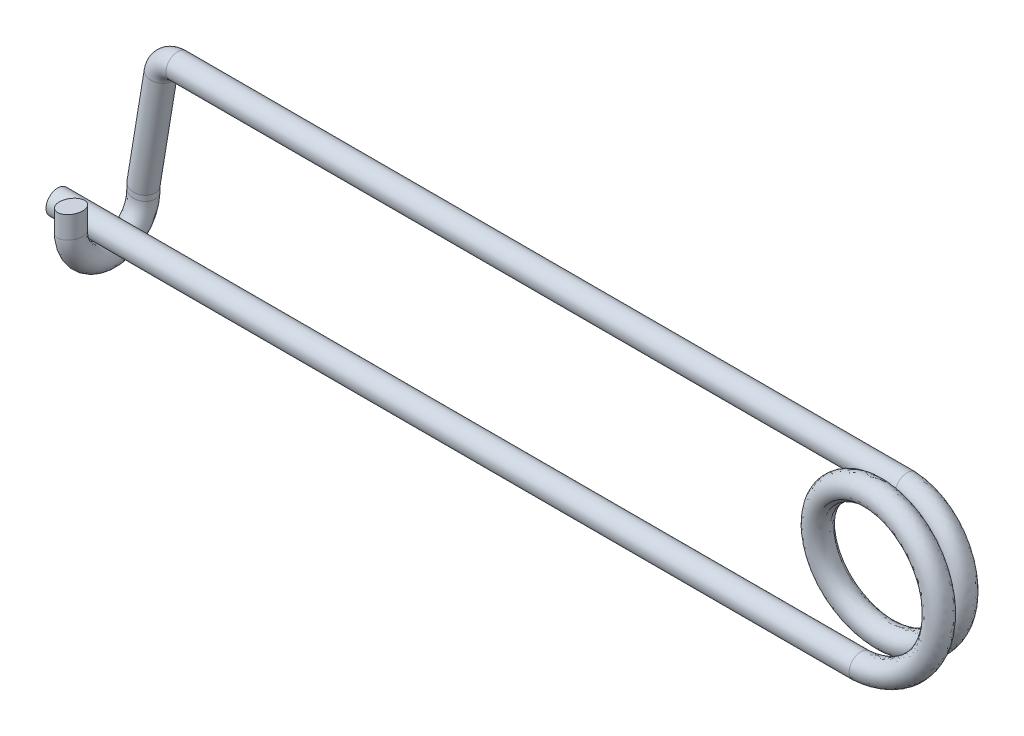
ISO-10303-21;
HEADER;
FILE_DESCRIPTION(('STEP AP214'),'2;1');
FILE_NAME('part.step','',(''),(''),'','','');
FILE_SCHEMA(('AUTOMOTIVE_DESIGN { 1 0 10303 214 1 1 1 1 }'));
ENDSEC;
DATA;
#1=APPLICATION_CONTEXT('core data for automotive mechanical design processes');
#2=APPLICATION_PROTOCOL_DEFINITION('international standard','automotive_design',2000,#1);
#3=PRODUCT_CONTEXT('',#1,'mechanical');
#4=PRODUCT('Part','Part','',(#3));
#5=PRODUCT_RELATED_PRODUCT_CATEGORY('part','',(#4));
#6=PRODUCT_DEFINITION_FORMATION('','',#4);
#7=PRODUCT_DEFINITION_CONTEXT('part definition',#1,'design');
#8=PRODUCT_DEFINITION('design','',#6,#7);
#9=PRODUCT_DEFINITION_SHAPE('','',#8);
#10=(LENGTH_UNIT() NAMED_UNIT(*) SI_UNIT(.MILLI.,.METRE.));
#11=(NAMED_UNIT(*) PLANE_ANGLE_UNIT() SI_UNIT($,.RADIAN.));
#12=(NAMED_UNIT(*) SI_UNIT($,.STERADIAN.) SOLID_ANGLE_UNIT());
#13=UNCERTAINTY_MEASURE_WITH_UNIT(LENGTH_MEASURE(1.E-05),#10,'distance_accuracy_value','');
#14=(GEOMETRIC_REPRESENTATION_CONTEXT(3) GLOBAL_UNCERTAINTY_ASSIGNED_CONTEXT((#13)) GLOBAL_UNIT_ASSIGNED_CONTEXT((#10,
#11,#12)) REPRESENTATION_CONTEXT('',''));
#15=CARTESIAN_POINT('',(0.,0.,0.));
#16=DIRECTION('',(0.,0.,1.));
#17=DIRECTION('',(1.,0.,0.));
#18=AXIS2_PLACEMENT_3D('',#15,#16,#17);
#19=CARTESIAN_POINT('',(0.,4.53789822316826,-0.9));
#20=CARTESIAN_POINT('',(0.89101638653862,4.55743632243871,-0.827083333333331));
#21=CARTESIAN_POINT('',(1.79241105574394,4.3070293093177,-0.754166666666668));
#22=CARTESIAN_POINT('',(3.31495955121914,3.33669097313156,-0.608333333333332));
#23=CARTESIAN_POINT('',(3.93294054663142,2.61841706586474,-0.535416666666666));
#24=CARTESIAN_POINT('',(4.66861070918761,0.944462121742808,-0.389583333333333));
#25=CARTESIAN_POINT('',(4.78456802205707,-0.0080378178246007,-0.316666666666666));
#26=CARTESIAN_POINT('',(4.46176535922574,-1.83117224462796,-0.170833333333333));
#27=CARTESIAN_POINT('',(4.02334156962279,-2.69815510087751,-0.0979166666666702));
#28=CARTESIAN_POINT('',(2.72578585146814,-4.05097232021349,0.0479166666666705));
#29=CARTESIAN_POINT('',(1.86899425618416,-4.53392517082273,0.12083333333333));
#30=CARTESIAN_POINT('',(0.0159558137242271,-4.94235875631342,0.266666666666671));
#31=CARTESIAN_POINT('',(-0.976699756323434,-4.86673497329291,0.33958333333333));
#32=CARTESIAN_POINT('',(-2.76562393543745,-4.16803363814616,0.485416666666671));
#33=CARTESIAN_POINT('',(-3.55825097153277,-3.54605027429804,0.558333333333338));
#34=CARTESIAN_POINT('',(-4.6702972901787,-1.95208989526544,0.704166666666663));
#35=CARTESIAN_POINT('',(-4.98727141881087,-0.983083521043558,0.777083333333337));
#36=CARTESIAN_POINT('',(-5.02634720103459,0.983083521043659,0.922916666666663));
#37=CARTESIAN_POINT('',(-4.74806618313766,1.97637038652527,0.995833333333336));
#38=CARTESIAN_POINT('',(-3.67542473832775,3.6520263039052,1.14166666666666));
#39=CARTESIAN_POINT('',(-2.8829234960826,4.33092409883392,1.21458333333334));
#40=CARTESIAN_POINT('',(-1.03884469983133,5.1370618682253,1.36041666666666));
#41=CARTESIAN_POINT('',(0.00921657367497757,5.26243115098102,1.43333333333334));
#42=CARTESIAN_POINT('',(2.01295351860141,4.90370441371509,1.57916666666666));
#43=CARTESIAN_POINT('',(2.96462173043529,4.42001535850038,1.65208333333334));
#44=CARTESIAN_POINT('',(4.44764610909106,2.99225248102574,1.79791666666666));
#45=CARTESIAN_POINT('',(4.97586422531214,2.05077553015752,1.87083333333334));
#46=CARTESIAN_POINT('',(5.42022188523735,0.0171345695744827,2.01666666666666));
#47=CARTESIAN_POINT('',(5.33518613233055,-1.07108233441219,2.08958333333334));
#48=CARTESIAN_POINT('',(4.56601719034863,-3.03013036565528,2.23541666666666));
#49=CARTESIAN_POINT('',(3.88311702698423,-3.89698473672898,2.30833333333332));
#50=CARTESIAN_POINT('',(2.13604922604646,-5.11133416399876,2.45416666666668));
#51=CARTESIAN_POINT('',(1.07515778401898,-5.45618228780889,2.52708333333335));
#52=CARTESIAN_POINT('',(-1.11435929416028E-13,-5.47572039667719,2.6));
#53=CARTESIAN_POINT('',(0.,6.33789822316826,-0.9));
#54=CARTESIAN_POINT('',(1.24444641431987,6.35743632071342,-0.827083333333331));
#55=CARTESIAN_POINT('',(2.49857221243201,6.00002910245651,-0.754166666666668));
#56=CARTESIAN_POINT('',(4.60885123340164,4.63698178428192,-0.608333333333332));
#57=CARTESIAN_POINT('',(5.46067237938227,3.63377282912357,-0.535416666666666));
#58=CARTESIAN_POINT('',(6.4668451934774,1.30676671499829,-0.389583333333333));
#59=CARTESIAN_POINT('',(6.61893205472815,-0.0125626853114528,-0.316666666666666));
#60=CARTESIAN_POINT('',(6.15822833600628,-2.52897253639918,-0.170833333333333));
#61=CARTESIAN_POINT('',(5.54604563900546,-3.7210354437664,-0.0979166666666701));
#62=CARTESIAN_POINT('',(3.74866619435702,-5.57367638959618,0.0479166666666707));
#63=CARTESIAN_POINT('',(2.56679454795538,-6.23038814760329,0.12083333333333));
#64=CARTESIAN_POINT('',(0.0204806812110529,-6.7767227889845,0.266666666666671));
#65=CARTESIAN_POINT('',(-1.33900434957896,-6.66496945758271,0.33958333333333));
#66=CARTESIAN_POINT('',(-3.78097969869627,-5.69576547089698,0.485416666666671));
#67=CARTESIAN_POINT('',(-4.85854178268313,-4.83994195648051,0.558333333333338));
#68=CARTESIAN_POINT('',(-6.36329708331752,-2.65825105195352,0.704166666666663));
#69=CARTESIAN_POINT('',(-6.78727141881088,-1.33651226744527,0.777083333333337));
#70=CARTESIAN_POINT('',(-6.82634720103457,1.33651226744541,0.922916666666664));
#71=CARTESIAN_POINT('',(-6.44106597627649,2.68253154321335,0.995833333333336));
#72=CARTESIAN_POINT('',(-4.97571554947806,4.94591798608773,1.14166666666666));
#73=CARTESIAN_POINT('',(-3.89827925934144,5.85865593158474,1.21458333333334));
#74=CARTESIAN_POINT('',(-1.40114929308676,6.93529635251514,1.36041666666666));
#75=CARTESIAN_POINT('',(0.0137414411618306,7.09679518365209,1.43333333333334));
#76=CARTESIAN_POINT('',(2.71075381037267,6.60016739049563,1.57916666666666));
#77=CARTESIAN_POINT('',(3.98750207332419,5.94271942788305,1.65208333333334));
#78=CARTESIAN_POINT('',(5.97035017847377,4.01513282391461,1.79791666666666));
#79=CARTESIAN_POINT('',(6.6723272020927,2.74857582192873,1.87083333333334));
#80=CARTESIAN_POINT('',(7.25458591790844,0.0216594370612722,2.01666666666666));
#81=CARTESIAN_POINT('',(7.13342061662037,-1.43338692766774,2.08958333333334));
#82=CARTESIAN_POINT('',(6.09374902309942,-4.04548612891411,2.23541666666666));
#83=CARTESIAN_POINT('',(5.17700870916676,-5.19727554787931,2.30833333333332));
#84=CARTESIAN_POINT('',(2.84221038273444,-6.80433395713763,2.45416666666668));
#85=CARTESIAN_POINT('',(1.42858781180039,-7.25618228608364,2.52708333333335));
#86=CARTESIAN_POINT('',(-1.4914394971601E-13,-7.27572039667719,2.6));
#87=CARTESIAN_POINT('',(0.,6.33789822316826,0.9));
#88=CARTESIAN_POINT('',(1.24444641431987,6.35743632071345,0.972916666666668));
#89=CARTESIAN_POINT('',(2.49857221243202,6.00002910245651,1.04583333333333));
#90=CARTESIAN_POINT('',(4.60885123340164,4.63698178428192,1.19166666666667));
#91=CARTESIAN_POINT('',(5.46067237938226,3.63377282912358,1.26458333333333));
#92=CARTESIAN_POINT('',(6.46684519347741,1.30676671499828,1.41041666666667));
#93=CARTESIAN_POINT('',(6.61893205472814,-0.0125626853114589,1.48333333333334));
#94=CARTESIAN_POINT('',(6.15822833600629,-2.52897253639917,1.62916666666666));
#95=CARTESIAN_POINT('',(5.54604563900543,-3.72103544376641,1.70208333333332));
#96=CARTESIAN_POINT('',(3.74866619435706,-5.57367638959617,1.84791666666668));
#97=CARTESIAN_POINT('',(2.56679454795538,-6.23038814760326,1.92083333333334));
#98=CARTESIAN_POINT('',(0.0204806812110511,-6.77672278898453,2.06666666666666));
#99=CARTESIAN_POINT('',(-1.33900434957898,-6.6649694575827,2.13958333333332));
#100=CARTESIAN_POINT('',(-3.78097969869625,-5.69576547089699,2.28541666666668));
#101=CARTESIAN_POINT('',(-4.85854178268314,-4.83994195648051,2.35833333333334));
#102=CARTESIAN_POINT('',(-6.36329708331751,-2.65825105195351,2.50416666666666));
#103=CARTESIAN_POINT('',(-6.78727141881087,-1.33651226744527,2.57708333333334));
#104=CARTESIAN_POINT('',(-6.82634720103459,1.33651226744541,2.72291666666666));
#105=CARTESIAN_POINT('',(-6.44106597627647,2.68253154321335,2.79583333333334));
#106=CARTESIAN_POINT('',(-4.97571554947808,4.94591798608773,2.94166666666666));
#107=CARTESIAN_POINT('',(-3.89827925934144,5.85865593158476,3.01458333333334));
#108=CARTESIAN_POINT('',(-1.40114929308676,6.93529635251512,3.16041666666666));
#109=CARTESIAN_POINT('',(0.0137414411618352,7.09679518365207,3.23333333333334));
#110=CARTESIAN_POINT('',(2.71075381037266,6.60016739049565,3.37916666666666));
#111=CARTESIAN_POINT('',(3.98750207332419,5.94271942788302,3.45208333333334));
#112=CARTESIAN_POINT('',(5.97035017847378,4.01513282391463,3.59791666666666));
#113=CARTESIAN_POINT('',(6.67232720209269,2.74857582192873,3.67083333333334));
#114=CARTESIAN_POINT('',(7.25458591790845,0.0216594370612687,3.81666666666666));
#115=CARTESIAN_POINT('',(7.13342061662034,-1.43338692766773,3.88958333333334));
#116=CARTESIAN_POINT('',(6.09374902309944,-4.04548612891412,4.03541666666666));
#117=CARTESIAN_POINT('',(5.17700870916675,-5.1972755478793,4.1083333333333));
#118=CARTESIAN_POINT('',(2.84221038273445,-6.80433395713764,4.25416666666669));
#119=CARTESIAN_POINT('',(1.42858781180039,-7.25618228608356,4.32708333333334));
#120=CARTESIAN_POINT('',(-1.4914394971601E-13,-7.27572039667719,4.4));
#121=CARTESIAN_POINT('',(0.,4.53789822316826,0.9));
#122=CARTESIAN_POINT('',(0.89101638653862,4.55743632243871,0.972916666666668));
#123=CARTESIAN_POINT('',(1.79241105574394,4.3070293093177,1.04583333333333));
#124=CARTESIAN_POINT('',(3.31495955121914,3.33669097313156,1.19166666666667));
#125=CARTESIAN_POINT('',(3.93294054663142,2.61841706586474,1.26458333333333));
#126=CARTESIAN_POINT('',(4.66861070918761,0.944462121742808,1.41041666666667));
#127=CARTESIAN_POINT('',(4.78456802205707,-0.00803781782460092,1.48333333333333));
#128=CARTESIAN_POINT('',(4.46176535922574,-1.83117224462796,1.62916666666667));
#129=CARTESIAN_POINT('',(4.02334156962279,-2.69815510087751,1.70208333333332));
#130=CARTESIAN_POINT('',(2.72578585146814,-4.05097232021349,1.84791666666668));
#131=CARTESIAN_POINT('',(1.86899425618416,-4.53392517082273,1.92083333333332));
#132=CARTESIAN_POINT('',(0.0159558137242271,-4.94235875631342,2.06666666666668));
#133=CARTESIAN_POINT('',(-0.976699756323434,-4.86673497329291,2.13958333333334));
#134=CARTESIAN_POINT('',(-2.76562393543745,-4.16803363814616,2.28541666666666));
#135=CARTESIAN_POINT('',(-3.55825097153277,-3.54605027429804,2.35833333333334));
#136=CARTESIAN_POINT('',(-4.6702972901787,-1.95208989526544,2.50416666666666));
#137=CARTESIAN_POINT('',(-4.98727141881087,-0.983083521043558,2.57708333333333));
#138=CARTESIAN_POINT('',(-5.02634720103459,0.983083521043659,2.72291666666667));
#139=CARTESIAN_POINT('',(-4.74806618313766,1.97637038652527,2.79583333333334));
#140=CARTESIAN_POINT('',(-3.67542473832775,3.6520263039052,2.94166666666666));
#141=CARTESIAN_POINT('',(-2.8829234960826,4.33092409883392,3.01458333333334));
#142=CARTESIAN_POINT('',(-1.03884469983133,5.1370618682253,3.16041666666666));
#143=CARTESIAN_POINT('',(0.00921657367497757,5.26243115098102,3.23333333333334));
#144=CARTESIAN_POINT('',(2.01295351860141,4.90370441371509,3.37916666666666));
#145=CARTESIAN_POINT('',(2.96462173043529,4.42001535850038,3.45208333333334));
#146=CARTESIAN_POINT('',(4.44764610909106,2.99225248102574,3.59791666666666));
#147=CARTESIAN_POINT('',(4.97586422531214,2.05077553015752,3.67083333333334));
#148=CARTESIAN_POINT('',(5.42022188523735,0.0171345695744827,3.81666666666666));
#149=CARTESIAN_POINT('',(5.33518613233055,-1.07108233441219,3.88958333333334));
#150=CARTESIAN_POINT('',(4.56601719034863,-3.03013036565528,4.03541666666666));
#151=CARTESIAN_POINT('',(3.88311702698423,-3.89698473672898,4.10833333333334));
#152=CARTESIAN_POINT('',(2.13604922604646,-5.11133416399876,4.25416666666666));
#153=CARTESIAN_POINT('',(1.07515778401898,-5.45618228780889,4.32708333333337));
#154=CARTESIAN_POINT('',(-1.11435929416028E-13,-5.47572039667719,4.4));
#155=CARTESIAN_POINT('',(0.,2.73789822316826,0.9));
#156=CARTESIAN_POINT('',(0.537586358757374,2.75743632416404,0.972916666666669));
#157=CARTESIAN_POINT('',(1.08624989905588,2.6140295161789,1.04583333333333));
#158=CARTESIAN_POINT('',(2.02106786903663,2.03640016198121,1.19166666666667));
#159=CARTESIAN_POINT('',(2.40520871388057,1.60306130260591,1.26458333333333));
#160=CARTESIAN_POINT('',(2.87037622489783,0.582157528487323,1.41041666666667));
#161=CARTESIAN_POINT('',(2.95020398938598,-0.00351295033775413,1.48333333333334));
#162=CARTESIAN_POINT('',(2.7653023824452,-1.13337195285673,1.62916666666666));
#163=CARTESIAN_POINT('',(2.50063750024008,-1.67527475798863,1.70208333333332));
#164=CARTESIAN_POINT('',(1.70290550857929,-2.52826825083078,1.84791666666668));
#165=CARTESIAN_POINT('',(1.17119396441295,-2.83746219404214,1.92083333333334));
#166=CARTESIAN_POINT('',(0.0114309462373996,-3.10799472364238,2.06666666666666));
#167=CARTESIAN_POINT('',(-0.614395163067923,-3.0685004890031,2.13958333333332));
#168=CARTESIAN_POINT('',(-1.75026817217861,-2.64030180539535,2.28541666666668));
#169=CARTESIAN_POINT('',(-2.25796016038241,-2.25215859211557,2.35833333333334));
#170=CARTESIAN_POINT('',(-2.97729749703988,-1.24592873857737,2.50416666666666));
#171=CARTESIAN_POINT('',(-3.18727141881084,-0.629654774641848,2.57708333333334));
#172=CARTESIAN_POINT('',(-3.22634720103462,0.629654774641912,2.72291666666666));
#173=CARTESIAN_POINT('',(-3.05506638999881,1.27020922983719,2.79583333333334));
#174=CARTESIAN_POINT('',(-2.37513392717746,2.35813462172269,2.94166666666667));
#175=CARTESIAN_POINT('',(-1.86756773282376,2.80319226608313,3.01458333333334));
#176=CARTESIAN_POINT('',(-0.676540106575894,3.33882738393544,3.16041666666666));
#177=CARTESIAN_POINT('',(0.00469170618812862,3.42806711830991,3.23333333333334));
#178=CARTESIAN_POINT('',(1.31515322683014,3.20724143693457,3.37916666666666));
#179=CARTESIAN_POINT('',(1.94174138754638,2.89731128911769,3.45208333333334));
#180=CARTESIAN_POINT('',(2.92494203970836,1.9693721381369,3.59791666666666));
#181=CARTESIAN_POINT('',(3.27940124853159,1.35297523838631,3.67083333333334));
#182=CARTESIAN_POINT('',(3.58585785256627,0.0126097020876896,3.81666666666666));
#183=CARTESIAN_POINT('',(3.53695164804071,-0.70877774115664,3.88958333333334));
#184=CARTESIAN_POINT('',(3.03828535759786,-2.01477460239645,4.03541666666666));
#185=CARTESIAN_POINT('',(2.58922534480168,-2.59669392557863,4.10833333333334));
#186=CARTESIAN_POINT('',(1.4298880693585,-3.41833437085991,4.25416666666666));
#187=CARTESIAN_POINT('',(0.721727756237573,-3.65618228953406,4.32708333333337));
#188=CARTESIAN_POINT('',(0.,-3.67572039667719,4.4));
#189=CARTESIAN_POINT('',(0.,2.73789822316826,-0.9));
#190=CARTESIAN_POINT('',(0.537586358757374,2.75743632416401,-0.827083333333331));
#191=CARTESIAN_POINT('',(1.08624989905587,2.6140295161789,-0.754166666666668));
#192=CARTESIAN_POINT('',(2.02106786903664,2.03640016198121,-0.608333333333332));
#193=CARTESIAN_POINT('',(2.40520871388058,1.6030613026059,-0.535416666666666));
#194=CARTESIAN_POINT('',(2.87037622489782,0.582157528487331,-0.389583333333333));
#195=CARTESIAN_POINT('',(2.95020398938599,-0.00351295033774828,-0.316666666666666));
#196=CARTESIAN_POINT('',(2.76530238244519,-1.13337195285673,-0.170833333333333));
#197=CARTESIAN_POINT('',(2.50063750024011,-1.67527475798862,-0.0979166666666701));
#198=CARTESIAN_POINT('',(1.70290550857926,-2.52826825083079,0.0479166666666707));
#199=CARTESIAN_POINT('',(1.17119396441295,-2.83746219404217,0.12083333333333));
#200=CARTESIAN_POINT('',(0.0114309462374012,-3.10799472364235,0.266666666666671));
#201=CARTESIAN_POINT('',(-0.614395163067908,-3.06850048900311,0.33958333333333));
#202=CARTESIAN_POINT('',(-1.75026817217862,-2.64030180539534,0.485416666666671));
#203=CARTESIAN_POINT('',(-2.25796016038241,-2.25215859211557,0.558333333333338));
#204=CARTESIAN_POINT('',(-2.97729749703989,-1.24592873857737,0.704166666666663));
#205=CARTESIAN_POINT('',(-3.18727141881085,-0.629654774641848,0.777083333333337));
#206=CARTESIAN_POINT('',(-3.22634720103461,0.629654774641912,0.922916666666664));
#207=CARTESIAN_POINT('',(-3.05506638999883,1.27020922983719,0.995833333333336));
#208=CARTESIAN_POINT('',(-2.37513392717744,2.35813462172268,1.14166666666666));
#209=CARTESIAN_POINT('',(-1.86756773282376,2.80319226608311,1.21458333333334));
#210=CARTESIAN_POINT('',(-0.676540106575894,3.33882738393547,1.36041666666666));
#211=CARTESIAN_POINT('',(0.00469170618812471,3.42806711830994,1.43333333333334));
#212=CARTESIAN_POINT('',(1.31515322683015,3.20724143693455,1.57916666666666));
#213=CARTESIAN_POINT('',(1.94174138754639,2.89731128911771,1.65208333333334));
#214=CARTESIAN_POINT('',(2.92494203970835,1.96937213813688,1.79791666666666));
#215=CARTESIAN_POINT('',(3.27940124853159,1.35297523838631,1.87083333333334));
#216=CARTESIAN_POINT('',(3.58585785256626,0.0126097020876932,2.01666666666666));
#217=CARTESIAN_POINT('',(3.53695164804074,-0.708777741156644,2.08958333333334));
#218=CARTESIAN_POINT('',(3.03828535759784,-2.01477460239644,2.23541666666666));
#219=CARTESIAN_POINT('',(2.58922534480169,-2.59669392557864,2.30833333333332));
#220=CARTESIAN_POINT('',(1.42988806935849,-3.4183343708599,2.45416666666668));
#221=CARTESIAN_POINT('',(0.721727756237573,-3.65618228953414,2.52708333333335));
#222=CARTESIAN_POINT('',(0.,-3.67572039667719,2.6));
#223=CARTESIAN_POINT('',(0.,4.53789822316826,-0.9));
#224=CARTESIAN_POINT('',(0.89101638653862,4.55743632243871,-0.827083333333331));
#225=CARTESIAN_POINT('',(1.79241105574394,4.3070293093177,-0.754166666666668));
#226=CARTESIAN_POINT('',(3.31495955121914,3.33669097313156,-0.608333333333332));
#227=CARTESIAN_POINT('',(3.93294054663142,2.61841706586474,-0.535416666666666));
#228=CARTESIAN_POINT('',(4.66861070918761,0.944462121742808,-0.389583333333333));
#229=CARTESIAN_POINT('',(4.78456802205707,-0.0080378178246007,-0.316666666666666));
#230=CARTESIAN_POINT('',(4.46176535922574,-1.83117224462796,-0.170833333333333));
#231=CARTESIAN_POINT('',(4.02334156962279,-2.69815510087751,-0.0979166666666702));
#232=CARTESIAN_POINT('',(2.72578585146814,-4.05097232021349,0.0479166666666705));
#233=CARTESIAN_POINT('',(1.86899425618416,-4.53392517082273,0.12083333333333));
#234=CARTESIAN_POINT('',(0.0159558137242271,-4.94235875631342,0.266666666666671));
#235=CARTESIAN_POINT('',(-0.976699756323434,-4.86673497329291,0.33958333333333));
#236=CARTESIAN_POINT('',(-2.76562393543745,-4.16803363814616,0.485416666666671));
#237=CARTESIAN_POINT('',(-3.55825097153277,-3.54605027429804,0.558333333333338));
#238=CARTESIAN_POINT('',(-4.6702972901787,-1.95208989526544,0.704166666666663));
#239=CARTESIAN_POINT('',(-4.98727141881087,-0.983083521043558,0.777083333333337));
#240=CARTESIAN_POINT('',(-5.02634720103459,0.983083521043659,0.922916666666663));
#241=CARTESIAN_POINT('',(-4.74806618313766,1.97637038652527,0.995833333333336));
#242=CARTESIAN_POINT('',(-3.67542473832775,3.6520263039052,1.14166666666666));
#243=CARTESIAN_POINT('',(-2.8829234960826,4.33092409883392,1.21458333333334));
#244=CARTESIAN_POINT('',(-1.03884469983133,5.1370618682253,1.36041666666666));
#245=CARTESIAN_POINT('',(0.00921657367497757,5.26243115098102,1.43333333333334));
#246=CARTESIAN_POINT('',(2.01295351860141,4.90370441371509,1.57916666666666));
#247=CARTESIAN_POINT('',(2.96462173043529,4.42001535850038,1.65208333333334));
#248=CARTESIAN_POINT('',(4.44764610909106,2.99225248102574,1.79791666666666));
#249=CARTESIAN_POINT('',(4.97586422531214,2.05077553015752,1.87083333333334));
#250=CARTESIAN_POINT('',(5.42022188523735,0.0171345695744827,2.01666666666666));
#251=CARTESIAN_POINT('',(5.33518613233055,-1.07108233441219,2.08958333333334));
#252=CARTESIAN_POINT('',(4.56601719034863,-3.03013036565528,2.23541666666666));
#253=CARTESIAN_POINT('',(3.88311702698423,-3.89698473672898,2.30833333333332));
#254=CARTESIAN_POINT('',(2.13604922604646,-5.11133416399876,2.45416666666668));
#255=CARTESIAN_POINT('',(1.07515778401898,-5.45618228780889,2.52708333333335));
#256=CARTESIAN_POINT('',(-1.11435929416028E-13,-5.47572039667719,2.6));
#257=(BOUNDED_SURFACE() B_SPLINE_SURFACE(3,3,((#19,#20,#21,#22,#23,#24,#25,#26,#27,#28,#29,#30,
#31,#32,#33,#34,#35,#36,#37,#38,#39,#40,#41,#42,#43,#44,#45,#46,#47,#48,#49,#50,#51,#52),(#53,
#54,#55,#56,#57,#58,#59,#60,#61,#62,#63,#64,#65,#66,#67,#68,#69,#70,#71,#72,#73,#74,#75,#76,#77,
#78,#79,#80,#81,#82,#83,#84,#85,#86),(#87,#88,#89,#90,#91,#92,#93,#94,#95,#96,#97,#98,#99,#100,
#101,#102,#103,#104,#105,#106,#107,#108,#109,#110,#111,#112,#113,#114,#115,#116,#117,#118,#119,
#120),(#121,#122,#123,#124,#125,#126,#127,#128,#129,#130,#131,#132,#133,#134,#135,#136,#137,
#138,#139,#140,#141,#142,#143,#144,#145,#146,#147,#148,#149,#150,#151,#152,#153,#154),(#155,
#156,#157,#158,#159,#160,#161,#162,#163,#164,#165,#166,#167,#168,#169,#170,#171,#172,#173,#174,
#175,#176,#177,#178,#179,#180,#181,#182,#183,#184,#185,#186,#187,#188),(#189,#190,#191,#192,
#193,#194,#195,#196,#197,#198,#199,#200,#201,#202,#203,#204,#205,#206,#207,#208,#209,#210,#211,
#212,#213,#214,#215,#216,#217,#218,#219,#220,#221,#222),(#223,#224,#225,#226,#227,#228,#229,
#230,#231,#232,#233,#234,#235,#236,#237,#238,#239,#240,#241,#242,#243,#244,#245,#246,#247,#248,
#249,#250,#251,#252,#253,#254,#255,#256)),.UNSPECIFIED.,.T.,.F.,
.F.) B_SPLINE_SURFACE_WITH_KNOTS((4,3,4),(4,2,2,2,2,2,2,2,2,2,2,2,2,2,2,2,4),(0.,0.5,1.),(0.,
0.0625,0.125,0.1875,0.25,0.3125,0.375,0.4375,0.5,0.5625,0.625,0.6875,0.75,0.8125,0.875,0.9375,
1.),.UNSPECIFIED.) GEOMETRIC_REPRESENTATION_ITEM() RATIONAL_B_SPLINE_SURFACE(((1.,1.,1.,1.,1.,
1.,1.,1.,1.,1.,1.,1.,1.,1.,1.,1.,1.,1.,1.,1.,1.,1.,1.,1.,1.,1.,1.,1.,1.,1.,1.,1.,1.,1.),
(0.333333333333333,0.333333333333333,0.333333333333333,0.333333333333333,0.333333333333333,
0.333333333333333,0.333333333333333,0.333333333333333,0.333333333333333,0.333333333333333,
0.333333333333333,0.333333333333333,0.333333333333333,0.333333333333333,0.333333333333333,
0.333333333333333,0.333333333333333,0.333333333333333,0.333333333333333,0.333333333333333,
0.333333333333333,0.333333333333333,0.333333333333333,0.333333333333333,0.333333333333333,
0.333333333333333,0.333333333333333,0.333333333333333,0.333333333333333,0.333333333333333,
0.333333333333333,0.333333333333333,0.333333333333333,0.333333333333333),(0.333333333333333,
0.333333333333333,0.333333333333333,0.333333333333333,0.333333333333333,0.333333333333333,
0.333333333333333,0.333333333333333,0.333333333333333,0.333333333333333,0.333333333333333,
0.333333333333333,0.333333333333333,0.333333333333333,0.333333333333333,0.333333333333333,
0.333333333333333,0.333333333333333,0.333333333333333,0.333333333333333,0.333333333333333,
0.333333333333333,0.333333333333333,0.333333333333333,0.333333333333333,0.333333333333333,
0.333333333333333,0.333333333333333,0.333333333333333,0.333333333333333,0.333333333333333,
0.333333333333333,0.333333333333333,0.333333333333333),(1.,1.,1.,1.,1.,1.,1.,1.,1.,1.,1.,1.,1.,
1.,1.,1.,1.,1.,1.,1.,1.,1.,1.,1.,1.,1.,1.,1.,1.,1.,1.,1.,1.,1.),(0.333333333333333,
0.333333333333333,0.333333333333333,0.333333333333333,0.333333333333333,0.333333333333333,
0.333333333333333,0.333333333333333,0.333333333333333,0.333333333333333,0.333333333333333,
0.333333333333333,0.333333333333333,0.333333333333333,0.333333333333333,0.333333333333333,
0.333333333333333,0.333333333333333,0.333333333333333,0.333333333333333,0.333333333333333,
0.333333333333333,0.333333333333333,0.333333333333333,0.333333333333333,0.333333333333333,
0.333333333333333,0.333333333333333,0.333333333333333,0.333333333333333,0.333333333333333,
0.333333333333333,0.333333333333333,0.333333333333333),(0.333333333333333,0.333333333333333,
0.333333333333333,0.333333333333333,0.333333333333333,0.333333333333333,0.333333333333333,
0.333333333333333,0.333333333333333,0.333333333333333,0.333333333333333,0.333333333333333,
0.333333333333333,0.333333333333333,0.333333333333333,0.333333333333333,0.333333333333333,
0.333333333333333,0.333333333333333,0.333333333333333,0.333333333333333,0.333333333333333,
0.333333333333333,0.333333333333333,0.333333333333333,0.333333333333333,0.333333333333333,
0.333333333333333,0.333333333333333,0.333333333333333,0.333333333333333,0.333333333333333,
0.333333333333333,0.333333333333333),(1.,1.,1.,1.,1.,1.,1.,1.,1.,1.,1.,1.,1.,1.,1.,1.,1.,1.,1.,
1.,1.,1.,1.,1.,1.,1.,1.,1.,1.,1.,1.,1.,1.,1.))) REPRESENTATION_ITEM('') SURFACE());
#258=CARTESIAN_POINT('',(-1.11435929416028E-13,-5.47572039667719,3.5));
#259=DIRECTION('',(-1.,0.,0.));
#260=DIRECTION('',(0.,0.,-1.));
#261=AXIS2_PLACEMENT_3D('',#258,#259,#260);
#262=CIRCLE('',#261,0.9);
#263=CARTESIAN_POINT('',(-1.11435929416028E-13,-5.47572039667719,2.6));
#264=VERTEX_POINT('',#263);
#265=EDGE_CURVE('E10',#264,#264,#262,.T.);
#266=CARTESIAN_POINT('',(0.,4.53789822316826,0.));
#267=DIRECTION('',(1.,0.,0.));
#268=DIRECTION('',(0.,0.,-1.));
#269=AXIS2_PLACEMENT_3D('',#266,#267,#268);
#270=CIRCLE('',#269,0.9);
#271=CARTESIAN_POINT('',(0.,4.53789822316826,-0.9));
#272=VERTEX_POINT('',#271);
#273=EDGE_CURVE('E40',#272,#272,#270,.T.);
#274=CARTESIAN_POINT('',(-1.11435929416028E-13,-5.47572039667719,2.6));
#275=CARTESIAN_POINT('',(0.0335908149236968,-5.47510999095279,2.59772188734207));
#276=CARTESIAN_POINT('',(0.0671757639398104,-5.47418186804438,2.59544322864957));
#277=CARTESIAN_POINT('',(0.134307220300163,-5.4716938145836,2.5908859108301));
#278=CARTESIAN_POINT('',(0.167853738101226,-5.47013416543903,2.58860725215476));
#279=CARTESIAN_POINT('',(0.234897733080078,-5.46638690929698,2.58404993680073));
#280=CARTESIAN_POINT('',(0.268395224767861,-5.46419956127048,2.58177128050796));
#281=CARTESIAN_POINT('',(0.33533060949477,-5.45920077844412,2.5772139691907));
#282=CARTESIAN_POINT('',(0.36876852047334,-5.45638958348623,2.57493531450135));
#283=CARTESIAN_POINT('',(0.435574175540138,-5.45014696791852,2.570378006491));
#284=CARTESIAN_POINT('',(0.468941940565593,-5.44671577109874,2.56809935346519));
#285=CARTESIAN_POINT('',(0.535596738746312,-5.43923701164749,2.56354204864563));
#286=CARTESIAN_POINT('',(0.568883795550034,-5.4351896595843,2.56126339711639));
#287=CARTESIAN_POINT('',(0.635366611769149,-5.42648244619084,2.55670609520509));
#288=CARTESIAN_POINT('',(0.668562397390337,-5.42182278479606,2.55442744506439));
#289=CARTESIAN_POINT('',(0.734852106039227,-5.41189480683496,2.54987014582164));
#290=CARTESIAN_POINT('',(0.767946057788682,-5.4066266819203,2.54759149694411));
#291=CARTESIAN_POINT('',(0.834021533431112,-5.39548562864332,2.54303420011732));
#292=CARTESIAN_POINT('',(0.867003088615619,-5.38961288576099,2.54075555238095));
#293=CARTESIAN_POINT('',(0.9328432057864,-5.37726644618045,2.53619825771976));
#294=CARTESIAN_POINT('',(0.965701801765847,-5.37079293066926,2.53391961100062));
#295=CARTESIAN_POINT('',(1.03128543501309,-5.35724879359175,2.52936231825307));
#296=CARTESIAN_POINT('',(1.06401050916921,-5.35017835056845,2.52708367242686));
#297=CARTESIAN_POINT('',(1.12931653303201,-5.33544420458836,2.5225263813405));
#298=CARTESIAN_POINT('',(1.16189752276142,-5.32778067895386,2.5202477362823));
#299=CARTESIAN_POINT('',(1.22690481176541,-5.31186421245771,2.51569044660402));
#300=CARTESIAN_POINT('',(1.25933115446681,-5.30361144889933,2.5134118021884));
#301=CARTESIAN_POINT('',(1.32401858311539,-5.28652035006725,2.50885451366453));
#302=CARTESIAN_POINT('',(1.35627971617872,-5.27768219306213,2.50657586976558));
#303=CARTESIAN_POINT('',(1.42062615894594,-5.25942414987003,2.50201858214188));
#304=CARTESIAN_POINT('',(1.45271151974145,-5.25000444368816,2.49973993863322));
#305=CARTESIAN_POINT('',(1.51669585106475,-5.23058714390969,2.4951826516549));
#306=CARTESIAN_POINT('',(1.54859487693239,-5.22058973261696,2.49290400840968));
#307=CARTESIAN_POINT('',(1.6121959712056,-5.2000208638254,2.48834672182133));
#308=CARTESIAN_POINT('',(1.64389809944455,-5.18944959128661,2.48606807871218));
#309=CARTESIAN_POINT('',(1.70709483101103,-5.16773684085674,2.48151079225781));
#310=CARTESIAN_POINT('',(1.73858949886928,-5.15659555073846,2.47923214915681));
#311=CARTESIAN_POINT('',(1.80136074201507,-5.13374660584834,2.47467486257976));
#312=CARTESIAN_POINT('',(1.83263738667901,-5.12203914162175,2.47239621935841));
#313=CARTESIAN_POINT('',(1.89496201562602,-5.09806168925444,2.46783893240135));
#314=CARTESIAN_POINT('',(1.92601007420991,-5.08579189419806,2.46556028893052));
#315=CARTESIAN_POINT('',(1.98786696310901,-5.06069362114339,2.46100300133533));
#316=CARTESIAN_POINT('',(2.01867587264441,-5.04786533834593,2.45872435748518));
#317=CARTESIAN_POINT('',(2.08004389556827,-5.02165393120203,2.45416706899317));
#318=CARTESIAN_POINT('',(2.11060309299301,-5.00827100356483,2.45188842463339));
#319=CARTESIAN_POINT('',(2.17146112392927,-4.98095414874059,2.44733113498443));
#320=CARTESIAN_POINT('',(2.20176004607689,-4.96702041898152,2.44505248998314));
#321=CARTESIAN_POINT('',(2.2620869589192,-4.93860580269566,2.44049519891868));
#322=CARTESIAN_POINT('',(2.29211504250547,-4.92412511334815,2.4382165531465));
#323=CARTESIAN_POINT('',(2.35188971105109,-4.89462042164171,2.43365926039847));
#324=CARTESIAN_POINT('',(2.3816363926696,-4.87959661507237,2.43138061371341));
#325=CARTESIAN_POINT('',(2.44083769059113,-4.84900953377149,2.42682331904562));
#326=CARTESIAN_POINT('',(2.47029240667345,-4.83344645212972,2.42454467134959));
#327=CARTESIAN_POINT('',(2.52889920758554,-4.80178466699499,2.41998737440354));
#328=CARTESIAN_POINT('',(2.55805139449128,-4.78568615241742,2.41770872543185));
#329=CARTESIAN_POINT('',(2.61604257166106,-4.7529573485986,2.41315142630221));
#330=CARTESIAN_POINT('',(2.64488166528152,-4.73632724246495,2.41087277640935));
#331=CARTESIAN_POINT('',(2.70223609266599,-4.70253910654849,2.40631547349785));
#332=CARTESIAN_POINT('',(2.73075152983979,-4.68538125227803,2.40403682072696));
#333=CARTESIAN_POINT('',(2.78744807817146,-4.65054146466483,2.39947951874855));
#334=CARTESIAN_POINT('',(2.81562929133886,-4.63285969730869,2.39720086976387));
#335=CARTESIAN_POINT('',(2.87164684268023,-4.59697596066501,2.39264354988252));
#336=CARTESIAN_POINT('',(2.8994832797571,-4.57877414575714,2.39036487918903));
#337=CARTESIAN_POINT('',(2.95480067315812,-4.54185407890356,2.38580761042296));
#338=CARTESIAN_POINT('',(2.98228172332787,-4.52313596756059,2.38352901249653));
#339=CARTESIAN_POINT('',(3.03687464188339,-4.4851898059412,2.37897181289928));
#340=CARTESIAN_POINT('',(3.063986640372,-4.46596194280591,2.3766932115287));
#341=CARTESIAN_POINT('',(3.11783157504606,-4.42700784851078,2.37213593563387));
#342=CARTESIAN_POINT('',(3.14456467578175,-4.40728184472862,2.36985726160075));
#343=CARTESIAN_POINT('',(3.19764520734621,-4.36734037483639,2.3652999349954));
#344=CARTESIAN_POINT('',(3.22399279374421,-4.34712511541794,2.36302128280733));
#345=CARTESIAN_POINT('',(3.27629574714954,-4.30621414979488,2.358463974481));
#346=CARTESIAN_POINT('',(3.30225126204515,-4.28551863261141,2.35618531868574));
#347=CARTESIAN_POINT('',(3.35376350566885,-4.24365613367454,2.35162800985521));
#348=CARTESIAN_POINT('',(3.37932037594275,-4.2224893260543,2.34934935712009));
#349=CARTESIAN_POINT('',(3.43002876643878,-4.17969323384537,2.34479205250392));
#350=CARTESIAN_POINT('',(3.45518042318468,-4.15806411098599,2.34251340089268));
#351=CARTESIAN_POINT('',(3.50507182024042,-4.1143523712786,2.33795609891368));
#352=CARTESIAN_POINT('',(3.52981169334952,-4.09226990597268,2.33567744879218));
#353=CARTESIAN_POINT('',(3.57887295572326,-4.04766046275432,2.33112014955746));
#354=CARTESIAN_POINT('',(3.6031944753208,-4.02513362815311,2.32884150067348));
#355=CARTESIAN_POINT('',(3.65141246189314,-3.97964442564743,2.32428420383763));
#356=CARTESIAN_POINT('',(3.67530905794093,-3.95668219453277,2.32200555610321));
#357=CARTESIAN_POINT('',(3.7226706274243,-3.91033117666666,2.31744826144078));
#358=CARTESIAN_POINT('',(3.7461357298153,-3.88694252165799,2.31516961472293));
#359=CARTESIAN_POINT('',(3.79262774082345,-3.83974763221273,2.31061232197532));
#360=CARTESIAN_POINT('',(3.81565477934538,-3.81594152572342,2.30833367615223));
#361=CARTESIAN_POINT('',(3.86126409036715,-3.76792070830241,2.30377638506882));
#362=CARTESIAN_POINT('',(3.88384649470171,-3.74370612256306,2.30149774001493));
#363=CARTESIAN_POINT('',(3.9285599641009,-3.69487732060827,2.29694045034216));
#364=CARTESIAN_POINT('',(3.9506911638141,-3.67026322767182,2.29466180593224));
#365=CARTESIAN_POINT('',(3.99449564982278,-3.62064438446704,2.29010451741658));
#366=CARTESIAN_POINT('',(4.01616907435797,-3.59563975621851,2.2878258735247));
#367=CARTESIAN_POINT('',(4.05905143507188,-3.54524881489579,2.28326858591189));
#368=CARTESIAN_POINT('',(4.08026051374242,-3.5198626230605,2.28098994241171));
#369=CARTESIAN_POINT('',(4.12220760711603,-3.46871752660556,2.27643265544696));
#370=CARTESIAN_POINT('',(4.14294576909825,-3.44295874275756,2.27415401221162));
#371=CARTESIAN_POINT('',(4.18394445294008,-3.39107743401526,2.26959672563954));
#372=CARTESIAN_POINT('',(4.20420512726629,-3.36495502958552,2.26731808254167));
#373=CARTESIAN_POINT('',(4.24424225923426,-3.31235545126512,2.26276079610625));
#374=CARTESIAN_POINT('',(4.26401887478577,-3.28587839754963,2.26048215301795));
#375=CARTESIAN_POINT('',(4.3030813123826,-3.23257849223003,2.25592486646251));
#376=CARTESIAN_POINT('',(4.32236729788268,-3.20575576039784,2.25364622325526));
#377=CARTESIAN_POINT('',(4.36044189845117,-3.15177347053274,2.24908893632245));
#378=CARTESIAN_POINT('',(4.37923068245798,-3.12461403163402,2.24681029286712));
#379=CARTESIAN_POINT('',(4.41630430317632,-3.06996729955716,2.24225300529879));
#380=CARTESIAN_POINT('',(4.43458931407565,-3.0424801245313,2.23997436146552));
#381=CARTESIAN_POINT('',(4.47064881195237,-2.98718689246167,2.23541707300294));
#382=CARTESIAN_POINT('',(4.48842347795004,-2.95938095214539,2.23313842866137));
#383=CARTESIAN_POINT('',(4.52345570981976,-2.903459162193,2.22858113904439));
#384=CARTESIAN_POINT('',(4.54071345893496,-2.87534342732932,2.22630249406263));
#385=CARTESIAN_POINT('',(4.57470528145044,-2.81881102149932,2.22174520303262));
#386=CARTESIAN_POINT('',(4.59143954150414,-2.7903944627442,2.21946655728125));
#387=CARTESIAN_POINT('',(4.62437781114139,-2.73326938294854,2.2149092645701));
#388=CARTESIAN_POINT('',(4.64058200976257,-2.70456097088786,2.21263061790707));
#389=CARTESIAN_POINT('',(4.6724535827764,-2.64686115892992,2.20807332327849));
#390=CARTESIAN_POINT('',(4.68812114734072,-2.61786986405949,2.20579467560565));
#391=CARTESIAN_POINT('',(4.71891287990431,-2.55961326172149,2.20123737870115));
#392=CARTESIAN_POINT('',(4.73403723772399,-2.53034805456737,2.19895872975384));
#393=CARTESIAN_POINT('',(4.76373598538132,-2.47155260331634,2.1944014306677));
#394=CARTESIAN_POINT('',(4.77831056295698,-2.44202245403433,2.19212278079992));
#395=CARTESIAN_POINT('',(4.80690318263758,-2.38270609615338,2.1875654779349));
#396=CARTESIAN_POINT('',(4.82092140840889,-2.35291997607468,2.18528682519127));
#397=CARTESIAN_POINT('',(4.8483947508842,-2.29310065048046,2.18072952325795));
#398=CARTESIAN_POINT('',(4.86185004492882,-2.26306752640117,2.17845087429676));
#399=CARTESIAN_POINT('',(4.88819098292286,-2.20276318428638,2.173893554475));
#400=CARTESIAN_POINT('',(4.90107679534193,-2.17249203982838,2.17161488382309));
#401=CARTESIAN_POINT('',(4.92627211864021,-2.11172058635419,2.16705761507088));
#402=CARTESIAN_POINT('',(4.93858178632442,-2.08122034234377,2.16477901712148));
#403=CARTESIAN_POINT('',(4.96261713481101,-2.02000356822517,2.16022181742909));
#404=CARTESIAN_POINT('',(4.97434302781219,-1.98928712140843,2.15794321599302));
#405=CARTESIAN_POINT('',(4.99720907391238,-1.92765288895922,2.15338594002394));
#406=CARTESIAN_POINT('',(5.00834948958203,-1.89673520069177,2.15110726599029));
#407=CARTESIAN_POINT('',(5.03004404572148,-1.83470944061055,2.14654993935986));
#408=CARTESIAN_POINT('',(5.0405984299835,-1.80360145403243,2.14427128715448));
#409=CARTESIAN_POINT('',(5.06112049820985,-1.74120611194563,2.13971397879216));
#410=CARTESIAN_POINT('',(5.0710884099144,-1.7099188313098,2.13743532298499));
#411=CARTESIAN_POINT('',(5.09043707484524,-1.64717589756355,2.13287801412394));
#412=CARTESIAN_POINT('',(5.09981804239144,-1.61572031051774,2.13059936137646));
#413=CARTESIAN_POINT('',(5.11799236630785,-1.55265176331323,2.12604205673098));
#414=CARTESIAN_POINT('',(5.12678592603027,-1.52103886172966,2.12376340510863));
#415=CARTESIAN_POINT('',(5.1437849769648,-1.45766668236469,2.11920610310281));
#416=CARTESIAN_POINT('',(5.15199066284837,-1.42590745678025,2.11692745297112));
#417=CARTESIAN_POINT('',(5.1678135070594,-1.36225362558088,2.11237015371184));
#418=CARTESIAN_POINT('',(5.17543085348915,-1.33035906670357,2.1100915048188));
#419=CARTESIAN_POINT('',(5.19007655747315,-1.26644556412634,2.10553420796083));
#420=CARTESIAN_POINT('',(5.19710509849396,-1.23442666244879,2.1032555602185));
#421=CARTESIAN_POINT('',(5.21057272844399,-1.17027546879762,2.09869826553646));
#422=CARTESIAN_POINT('',(5.21701199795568,-1.13814321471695,2.09641961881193));
#423=CARTESIAN_POINT('',(5.22930061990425,-1.0737763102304,2.09186232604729));
#424=CARTESIAN_POINT('',(5.23515015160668,-1.04154169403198,2.08958368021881));
#425=CARTESIAN_POINT('',(5.24625883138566,-0.97698105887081,2.08502638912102));
#426=CARTESIAN_POINT('',(5.25151815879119,-0.944655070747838,2.08274774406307));
#427=CARTESIAN_POINT('',(5.26144596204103,-0.879922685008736,2.07819045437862));
#428=CARTESIAN_POINT('',(5.26611461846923,-0.847516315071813,2.07591180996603));
#429=CARTESIAN_POINT('',(5.2748606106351,-0.782634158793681,2.07135452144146));
#430=CARTESIAN_POINT('',(5.27893812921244,-0.750158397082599,2.06907587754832));
#431=CARTESIAN_POINT('',(5.28650137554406,-0.685148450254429,2.0645185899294));
#432=CARTESIAN_POINT('',(5.28998728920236,-0.652614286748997,2.06223994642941));
#433=CARTESIAN_POINT('',(5.29636685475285,-0.587498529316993,2.05768265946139));
#434=CARTESIAN_POINT('',(5.29926069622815,-0.554916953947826,2.05540401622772));
#435=CARTESIAN_POINT('',(5.30445564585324,-0.489717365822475,2.05084672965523));
#436=CARTESIAN_POINT('',(5.30675694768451,-0.45709936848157,2.04856808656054));
#437=CARTESIAN_POINT('',(5.31076634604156,-0.391837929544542,2.04401080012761));
#438=CARTESIAN_POINT('',(5.31247464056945,-0.359194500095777,2.04173215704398));
#439=CARTESIAN_POINT('',(5.31529755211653,-0.293893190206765,2.03717487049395));
#440=CARTESIAN_POINT('',(5.31641237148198,-0.261235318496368,2.03489622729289));
#441=CARTESIAN_POINT('',(5.31804786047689,-0.195916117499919,2.0303389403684));
#442=CARTESIAN_POINT('',(5.3185687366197,-0.163254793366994,2.02806029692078));
#443=CARTESIAN_POINT('',(5.31901586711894,-0.097939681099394,2.0235030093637));
#444=CARTESIAN_POINT('',(5.31894233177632,-0.065285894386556,2.02122436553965));
#445=CARTESIAN_POINT('',(5.31820016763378,3.14931713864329E-06,2.01666707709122));
#446=CARTESIAN_POINT('',(5.31753175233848,0.0326384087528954,2.0143884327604));
#447=CARTESIAN_POINT('',(5.31559935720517,0.0978794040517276,2.00983114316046));
#448=CARTESIAN_POINT('',(5.31433559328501,0.130485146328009,2.00755249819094));
#449=CARTESIAN_POINT('',(5.31121203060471,0.195656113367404,2.00299520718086));
#450=CARTESIAN_POINT('',(5.30935244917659,0.228221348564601,2.00071656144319));
#451=CARTESIAN_POINT('',(5.30503678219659,0.293300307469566,1.99615926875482));
#452=CARTESIAN_POINT('',(5.30258091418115,0.325814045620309,1.99388062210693));
#453=CARTESIAN_POINT('',(5.29707220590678,0.390779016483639,1.98932332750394));
#454=CARTESIAN_POINT('',(5.29401958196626,0.423230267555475,1.98704467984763));
#455=CARTESIAN_POINT('',(5.28731689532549,0.488059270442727,1.98248738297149));
#456=CARTESIAN_POINT('',(5.28366704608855,0.520437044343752,1.98020873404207));
#457=CARTESIAN_POINT('',(5.27576944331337,0.585108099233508,1.97565143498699));
#458=CARTESIAN_POINT('',(5.27152189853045,0.617401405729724,1.97337278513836));
#459=CARTESIAN_POINT('',(5.26242844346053,0.681892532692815,1.96881548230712));
#460=CARTESIAN_POINT('',(5.25758273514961,0.714090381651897,1.96653682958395));
#461=CARTESIAN_POINT('',(5.2472924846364,0.778379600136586,1.96197952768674));
#462=CARTESIAN_POINT('',(5.24184813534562,0.810471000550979,1.95970087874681));
#463=CARTESIAN_POINT('',(5.23036017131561,0.874536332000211,1.95514355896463));
#464=CARTESIAN_POINT('',(5.22431673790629,0.906510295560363,1.95286488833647));
#465=CARTESIAN_POINT('',(5.21163004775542,0.970329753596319,1.94830761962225));
#466=CARTESIAN_POINT('',(5.20498695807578,1.00217528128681,1.9460290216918));
#467=CARTESIAN_POINT('',(5.19110172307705,1.06572305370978,1.94147182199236));
#468=CARTESIAN_POINT('',(5.18385980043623,1.09742534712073,1.93919322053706));
#469=CARTESIAN_POINT('',(5.16878368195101,1.16067339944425,1.93463594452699));
#470=CARTESIAN_POINT('',(5.16094975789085,1.19221922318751,1.93235727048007));
#471=CARTESIAN_POINT('',(5.14469522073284,1.25514503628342,1.9277999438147));
#472=CARTESIAN_POINT('',(5.13627485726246,1.28652509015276,1.92552129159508));
#473=CARTESIAN_POINT('',(5.11885315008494,1.34911007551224,1.92096398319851));
#474=CARTESIAN_POINT('',(5.10985203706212,1.38031507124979,1.9186853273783));
#475=CARTESIAN_POINT('',(5.0912745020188,1.44254064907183,1.9141280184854));
#476=CARTESIAN_POINT('',(5.08169829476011,1.47356129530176,1.91184936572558));
#477=CARTESIAN_POINT('',(5.06197624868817,1.5354088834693,1.90729206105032));
#478=CARTESIAN_POINT('',(5.05183061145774,1.56623588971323,1.90501340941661));
#479=CARTESIAN_POINT('',(5.03097537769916,1.62768690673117,1.90045610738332));
#480=CARTESIAN_POINT('',(5.02026597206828,1.65831098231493,1.89817745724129));
#481=CARTESIAN_POINT('',(4.99828887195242,1.71934684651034,1.89362015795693));
#482=CARTESIAN_POINT('',(4.98702135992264,1.74975870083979,1.89134150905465));
#483=CARTESIAN_POINT('',(4.96393371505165,1.81036083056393,1.88678421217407));
#484=CARTESIAN_POINT('',(4.95211375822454,1.84055117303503,1.8845055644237));
#485=CARTESIAN_POINT('',(4.92792688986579,1.90070098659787,1.87994826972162));
#486=CARTESIAN_POINT('',(4.91556014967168,1.93066052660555,1.87766962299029));
#487=CARTESIAN_POINT('',(4.89028537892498,1.99033944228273,1.87311233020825));
#488=CARTESIAN_POINT('',(4.87737751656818,2.02005888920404,1.87083368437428));
#489=CARTESIAN_POINT('',(4.85102616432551,2.079248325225,1.8662763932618));
#490=CARTESIAN_POINT('',(4.83758284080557,2.10871838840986,1.86399774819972));
#491=CARTESIAN_POINT('',(4.8101662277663,2.1673997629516,1.85944045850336));
#492=CARTESIAN_POINT('',(4.79619310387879,2.19661115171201,1.85716181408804));
#493=CARTESIAN_POINT('',(4.76772255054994,2.25476588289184,1.85260452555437));
#494=CARTESIAN_POINT('',(4.75322528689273,2.28370930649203,1.85032588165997));
#495=CARTESIAN_POINT('',(4.72371211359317,2.34131881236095,1.8457685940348));
#496=CARTESIAN_POINT('',(4.70869637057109,2.36998498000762,1.84348995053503));
#497=CARTESIAN_POINT('',(4.67815189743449,2.42703067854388,1.83893266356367));
#498=CARTESIAN_POINT('',(4.66262333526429,2.45541029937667,1.83665402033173));
#499=CARTESIAN_POINT('',(4.63105888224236,2.51187360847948,1.83209673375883));
#500=CARTESIAN_POINT('',(4.61502316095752,2.53995739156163,1.8298180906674));
#501=CARTESIAN_POINT('',(4.58245004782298,2.59581972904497,1.82526080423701));
#502=CARTESIAN_POINT('',(4.56591282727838,2.62359838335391,1.82298216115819));
#503=CARTESIAN_POINT('',(4.53234237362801,2.67884116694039,1.81842487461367));
#504=CARTESIAN_POINT('',(4.51530931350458,2.70630540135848,1.81614623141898));
#505=CARTESIAN_POINT('',(4.48075283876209,2.76091004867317,1.81158894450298));
#506=CARTESIAN_POINT('',(4.46322959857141,2.78805057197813,1.80931030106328));
#507=CARTESIAN_POINT('',(4.42769842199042,2.84199850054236,1.80475301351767));
#508=CARTESIAN_POINT('',(4.40969066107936,2.86880602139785,1.80247436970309));
#509=CARTESIAN_POINT('',(4.37319610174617,2.92207864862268,1.79791708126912));
#510=CARTESIAN_POINT('',(4.35470947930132,2.94854387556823,1.79563843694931));
#511=CARTESIAN_POINT('',(4.31726285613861,3.00112261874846,1.79108114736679));
#512=CARTESIAN_POINT('',(4.29830303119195,3.02723626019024,1.7888025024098));
#513=CARTESIAN_POINT('',(4.25991566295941,3.07910253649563,1.78424521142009));
#514=CARTESIAN_POINT('',(4.24048829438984,3.10485530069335,1.78196656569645));
#515=CARTESIAN_POINT('',(4.20117149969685,3.15599052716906,1.77740927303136));
#516=CARTESIAN_POINT('',(4.18128224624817,3.18137312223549,1.77513062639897));
#517=CARTESIAN_POINT('',(4.14104734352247,3.23175871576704,1.77057333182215));
#518=CARTESIAN_POINT('',(4.12070186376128,3.2567618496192,1.76829468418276));
#519=CARTESIAN_POINT('',(4.07956017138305,3.30637922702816,1.76373738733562));
#520=CARTESIAN_POINT('',(4.05876412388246,3.33099360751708,1.7614587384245));
#521=CARTESIAN_POINT('',(4.01672695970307,3.37982418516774,1.75690143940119));
#522=CARTESIAN_POINT('',(3.99548600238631,3.40404051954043,1.75462278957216));
#523=CARTESIAN_POINT('',(3.952564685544,3.4520657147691,1.75006548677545));
#524=CARTESIAN_POINT('',(3.93088447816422,3.47587471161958,1.74778683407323));
#525=CARTESIAN_POINT('',(3.88709032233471,3.52307593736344,1.74322953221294));
#526=CARTESIAN_POINT('',(3.86497651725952,3.54646829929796,1.74095088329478));
#527=CARTESIAN_POINT('',(3.82032085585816,3.59282698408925,1.73639356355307));
#528=CARTESIAN_POINT('',(3.79777913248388,3.61579343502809,1.73411489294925));
#529=CARTESIAN_POINT('',(3.75227322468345,3.66129094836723,1.72955762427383));
#530=CARTESIAN_POINT('',(3.72930916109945,3.68382213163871,1.72727902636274));
#531=CARTESIAN_POINT('',(3.68296735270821,3.72843735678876,1.72272182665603));
#532=CARTESIAN_POINT('',(3.65958976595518,3.7505215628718,1.72044322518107));
#533=CARTESIAN_POINT('',(3.61243377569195,3.79423567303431,1.71588594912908));
#534=CARTESIAN_POINT('',(3.58865556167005,3.81586578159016,1.71360727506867));
#535=CARTESIAN_POINT('',(3.54070801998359,3.85866712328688,1.70904994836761));
#536=CARTESIAN_POINT('',(3.51653886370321,3.87983854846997,1.70677129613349));
#537=CARTESIAN_POINT('',(3.46781923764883,3.9217180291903,1.70221398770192));
#538=CARTESIAN_POINT('',(3.44326892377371,3.94242626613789,1.69993533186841));
#539=CARTESIAN_POINT('',(3.39379675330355,3.98337485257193,1.69537802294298));
#540=CARTESIAN_POINT('',(3.36887503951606,4.00361537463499,1.69309937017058));
#541=CARTESIAN_POINT('',(3.31866984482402,4.04362401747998,1.6885420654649));
#542=CARTESIAN_POINT('',(3.29338649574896,4.06339230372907,1.68626341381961));
#543=CARTESIAN_POINT('',(3.24246780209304,4.10245195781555,1.68170611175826));
#544=CARTESIAN_POINT('',(3.21683258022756,4.1217434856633,1.67942746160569));
#545=CARTESIAN_POINT('',(3.16521991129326,4.1598451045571,1.67487016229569));
#546=CARTESIAN_POINT('',(3.1392425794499,4.17865535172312,1.67259151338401));
#547=CARTESIAN_POINT('',(3.08695545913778,4.21578988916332,1.66803421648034));
#548=CARTESIAN_POINT('',(3.06064577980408,4.23411433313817,1.66575556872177));
#549=CARTESIAN_POINT('',(3.00770373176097,4.27027274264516,1.6611982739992));
#550=CARTESIAN_POINT('',(2.98107146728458,4.28810686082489,1.65891962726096));
#551=CARTESIAN_POINT('',(2.92749401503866,4.32328009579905,1.65436233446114));
#552=CARTESIAN_POINT('',(2.90054892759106,4.34061936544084,1.65208368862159));
#553=CARTESIAN_POINT('',(2.84635559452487,4.3747983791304,1.64752639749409));
#554=CARTESIAN_POINT('',(2.81910744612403,4.39163827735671,1.64524775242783));
#555=CARTESIAN_POINT('',(2.76431775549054,4.42481402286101,1.64069046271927));
#556=CARTESIAN_POINT('',(2.73677630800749,4.44115002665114,1.63841181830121));
#557=CARTESIAN_POINT('',(2.68140978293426,4.47331345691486,1.63385452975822));
#558=CARTESIAN_POINT('',(2.65358479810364,4.48914104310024,1.63157588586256));
#559=CARTESIAN_POINT('',(2.59766096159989,4.52028311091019,1.62701859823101));
#560=CARTESIAN_POINT('',(2.56956220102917,4.53559775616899,1.62473995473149));
#561=CARTESIAN_POINT('',(2.51310057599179,4.56570941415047,1.62018266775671));
#562=CARTESIAN_POINT('',(2.48473780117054,4.58050659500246,1.61790402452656));
#563=CARTESIAN_POINT('',(2.42775791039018,4.60957879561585,1.61334673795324));
#564=CARTESIAN_POINT('',(2.3991408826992,4.62385398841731,1.61106809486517));
#565=CARTESIAN_POINT('',(2.34166224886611,4.65187768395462,1.60651080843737));
#566=CARTESIAN_POINT('',(2.31280072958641,4.66562636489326,1.6042321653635));
#567=CARTESIAN_POINT('',(2.25484287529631,4.69259250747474,1.59967487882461));
#568=CARTESIAN_POINT('',(2.22574662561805,4.70581015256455,1.59739623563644));
#569=CARTESIAN_POINT('',(2.16732907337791,4.73170969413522,1.59283894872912));
#570=CARTESIAN_POINT('',(2.13800785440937,4.74439177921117,1.59056030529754));
#571=CARTESIAN_POINT('',(2.07915012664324,4.76921567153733,1.58600301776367));
#572=CARTESIAN_POINT('',(2.04961369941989,4.78135767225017,1.5837243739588));
#573=CARTESIAN_POINT('',(1.99033531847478,4.80509686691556,1.5791670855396));
#574=CARTESIAN_POINT('',(1.96059344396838,4.81669425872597,1.57688844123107));
#575=CARTESIAN_POINT('',(1.90091393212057,4.83933970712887,1.57233115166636));
#576=CARTESIAN_POINT('',(1.87097637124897,4.85038796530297,1.57005250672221));
#577=CARTESIAN_POINT('',(1.81091525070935,4.87193061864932,1.56549521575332));
#578=CARTESIAN_POINT('',(1.78079176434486,4.88242521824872,1.56321657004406));
#579=CARTESIAN_POINT('',(1.72036855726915,4.90285602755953,1.55865927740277));
#580=CARTESIAN_POINT('',(1.69006890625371,4.91279244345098,1.55638063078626));
#581=CARTESIAN_POINT('',(1.62930313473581,4.93210235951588,1.55182333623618));
#582=CARTESIAN_POINT('',(1.59883707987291,4.94147606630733,1.54954468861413));
#583=CARTESIAN_POINT('',(1.53774826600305,4.95965603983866,1.54498739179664));
#584=CARTESIAN_POINT('',(1.50712556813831,4.9684625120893,1.54270874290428));
#585=CARTESIAN_POINT('',(1.44573323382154,4.98550349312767,1.53815144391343));
#586=CARTESIAN_POINT('',(1.41496365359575,4.99373820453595,1.53587279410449));
#587=CARTESIAN_POINT('',(1.35328732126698,5.00963114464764,1.53131549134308));
#588=CARTESIAN_POINT('',(1.32238062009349,5.0172895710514,1.52903683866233));
#589=CARTESIAN_POINT('',(1.26043981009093,5.03202541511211,1.52447953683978));
#590=CARTESIAN_POINT('',(1.22940574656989,5.03910302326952,1.52220088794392));
#591=CARTESIAN_POINT('',(1.16721998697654,5.05267274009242,1.51764356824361));
#592=CARTESIAN_POINT('',(1.13606833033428,5.05916502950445,1.51536489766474));
#593=CARTESIAN_POINT('',(1.07365712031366,5.0715594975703,1.51080762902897));
#594=CARTESIAN_POINT('',(1.04239760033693,5.07746184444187,1.50852903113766));
#595=CARTESIAN_POINT('',(0.979784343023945,5.08867159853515,1.50397183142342));
#596=CARTESIAN_POINT('',(0.948430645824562,5.0939792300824,1.50169322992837));
#597=CARTESIAN_POINT('',(0.885643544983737,5.10400074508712,1.49713595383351));
#598=CARTESIAN_POINT('',(0.85421018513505,5.1087149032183,1.49485727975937));
#599=CARTESIAN_POINT('',(0.791274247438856,5.1175510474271,1.49029995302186));
#600=CARTESIAN_POINT('',(0.759771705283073,5.12167328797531,1.48802130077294));
#601=CARTESIAN_POINT('',(0.696707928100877,5.12932729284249,1.48346399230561));
#602=CARTESIAN_POINT('',(0.665146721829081,5.1328592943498,1.48118533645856));
#603=CARTESIAN_POINT('',(0.601976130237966,5.13933448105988,1.47662802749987));
#604=CARTESIAN_POINT('',(0.570366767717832,5.14227788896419,1.47434937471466));
#605=CARTESIAN_POINT('',(0.507110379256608,5.14757755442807,1.46979206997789));
#606=CARTESIAN_POINT('',(0.475463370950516,5.14993402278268,1.46751341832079));
#607=CARTESIAN_POINT('',(0.41214220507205,5.15406147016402,1.46295611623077));
#608=CARTESIAN_POINT('',(0.380468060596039,5.15583265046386,1.46067746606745));
#609=CARTESIAN_POINT('',(0.317103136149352,5.1587911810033,1.45612016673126));
#610=CARTESIAN_POINT('',(0.285412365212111,5.15997872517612,1.45384151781));
#611=CARTESIAN_POINT('',(0.222024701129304,5.16177164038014,1.44928422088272));
#612=CARTESIAN_POINT('',(0.190327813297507,5.16237719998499,1.4470055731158));
#613=CARTESIAN_POINT('',(0.126938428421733,5.16300780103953,1.4424482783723));
#614=CARTESIAN_POINT('',(0.095245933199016,5.16303302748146,1.44016963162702));
#615=CARTESIAN_POINT('',(0.0318758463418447,5.16250461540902,1.43561233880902));
#616=CARTESIAN_POINT('',(0.000198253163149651,5.16195115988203,1.43333369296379));
#617=CARTESIAN_POINT('',(-0.0631315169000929,5.16026703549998,1.42877640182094));
#618=CARTESIAN_POINT('',(-0.0947836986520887,5.15913654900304,1.42649775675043));
#619=CARTESIAN_POINT('',(-0.158052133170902,5.15630001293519,1.4219404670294));
#620=CARTESIAN_POINT('',(-0.18966839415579,5.15459414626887,1.41966182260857));
#621=CARTESIAN_POINT('',(-0.252854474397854,5.150608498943,1.41510453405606));
#622=CARTESIAN_POINT('',(-0.284424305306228,5.14832890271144,1.41282589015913));
#623=CARTESIAN_POINT('',(-0.347507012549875,5.14319744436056,1.40826860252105));
#624=CARTESIAN_POINT('',(-0.379019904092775,5.140345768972,1.40598995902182));
#625=CARTESIAN_POINT('',(-0.441978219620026,5.13407179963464,1.40143267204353));
#626=CARTESIAN_POINT('',(-0.473423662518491,5.13064969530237,1.39915402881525));
#627=CARTESIAN_POINT('',(-0.536236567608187,5.12323651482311,1.39459674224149));
#628=CARTESIAN_POINT('',(-0.567604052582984,5.11924563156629,1.39231809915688));
#629=CARTESIAN_POINT('',(-0.63025052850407,5.11069653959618,1.38776081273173));
#630=CARTESIAN_POINT('',(-0.661529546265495,5.10613852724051,1.38548216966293));
#631=CARTESIAN_POINT('',(-0.723988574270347,5.09645682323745,1.3809248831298));
#632=CARTESIAN_POINT('',(-0.755168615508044,5.09133333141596,1.37864623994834));
#633=CARTESIAN_POINT('',(-0.817419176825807,5.08052231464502,1.37408895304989));
#634=CARTESIAN_POINT('',(-0.84848973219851,5.07483499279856,1.37181030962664));
#635=CARTESIAN_POINT('',(-0.91051080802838,5.06289796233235,1.36725302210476));
#636=CARTESIAN_POINT('',(-0.941461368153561,5.05664845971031,1.36497437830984));
#637=CARTESIAN_POINT('',(-1.00323193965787,5.04358871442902,1.36041708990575));
#638=CARTESIAN_POINT('',(-1.03405199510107,5.03677868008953,1.35813844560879));
#639=CARTESIAN_POINT('',(-1.09555104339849,5.02259951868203,1.35358115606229));
#640=CARTESIAN_POINT('',(-1.1262300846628,5.01523060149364,1.3513025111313));
#641=CARTESIAN_POINT('',(-1.18743659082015,4.99993532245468,1.3467452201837));
#642=CARTESIAN_POINT('',(-1.21796410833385,4.99200917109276,1.34446657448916));
#643=CARTESIAN_POINT('',(-1.27885705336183,4.97560107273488,1.33990928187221));
#644=CARTESIAN_POINT('',(-1.30922253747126,4.96711933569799,1.33763063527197));
#645=CARTESIAN_POINT('',(-1.36978090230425,4.9496017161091,1.33307334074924));
#646=CARTESIAN_POINT('',(-1.39997384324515,4.94056604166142,1.33079469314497));
#647=CARTESIAN_POINT('',(-1.46017660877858,4.92194219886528,1.32623739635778));
#648=CARTESIAN_POINT('',(-1.49018649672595,4.91235423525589,1.32395874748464));
#649=CARTESIAN_POINT('',(-1.550012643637,4.89262746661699,1.319401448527));
#650=CARTESIAN_POINT('',(-1.57982896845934,4.8824888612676,1.31712279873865));
#651=CARTESIAN_POINT('',(-1.63925747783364,4.86166246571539,1.31256549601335));
#652=CARTESIAN_POINT('',(-1.66886972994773,4.85097486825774,1.31028684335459));
#653=CARTESIAN_POINT('',(-1.72787958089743,4.82905213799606,1.30572954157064));
#654=CARTESIAN_POINT('',(-1.75727724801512,4.81781718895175,1.30345089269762));
#655=CARTESIAN_POINT('',(-1.81584742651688,4.79480144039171,1.29889357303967));
#656=CARTESIAN_POINT('',(-1.84502000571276,4.78302081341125,1.29661490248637));
#657=CARTESIAN_POINT('',(-1.90312947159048,4.75891527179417,1.29205763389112));
#658=CARTESIAN_POINT('',(-1.93206642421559,4.74659051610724,1.28977903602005));
#659=CARTESIAN_POINT('',(-1.98969074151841,4.7214002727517,1.28522183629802));
#660=CARTESIAN_POINT('',(-2.0183781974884,4.70853499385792,1.28294323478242));
#661=CARTESIAN_POINT('',(-2.07549225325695,4.68227266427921,1.2783859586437));
#662=CARTESIAN_POINT('',(-2.10391896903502,4.66887586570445,1.27610728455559));
#663=CARTESIAN_POINT('',(-2.16050379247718,4.64155755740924,1.27154995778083));
#664=CARTESIAN_POINT('',(-2.18866201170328,4.62763627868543,1.26927130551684));
#665=CARTESIAN_POINT('',(-2.24470212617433,4.59927619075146,1.26471399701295));
#666=CARTESIAN_POINT('',(-2.27258412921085,4.58483759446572,1.26243534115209));
#667=CARTESIAN_POINT('',(-2.3280640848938,4.55545001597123,1.25787803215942));
#668=CARTESIAN_POINT('',(-2.35566214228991,4.54050123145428,1.25559937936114));
#669=CARTESIAN_POINT('',(-2.41056648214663,4.5101004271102,1.25104207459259));
#670=CARTESIAN_POINT('',(-2.43787286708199,4.49464859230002,1.24876342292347));
#671=CARTESIAN_POINT('',(-2.4921861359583,4.46324883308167,1.24420612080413));
#672=CARTESIAN_POINT('',(-2.51919312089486,4.44730108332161,1.24192747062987));
#673=CARTESIAN_POINT('',(-2.57289986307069,4.41491663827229,1.23737017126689));
#674=CARTESIAN_POINT('',(-2.59959972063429,4.39848010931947,1.23509152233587));
#675=CARTESIAN_POINT('',(-2.65268448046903,4.36512524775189,1.23053422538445));
#676=CARTESIAN_POINT('',(-2.67906948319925,4.34820707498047,1.22825557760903));
#677=CARTESIAN_POINT('',(-2.73151680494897,4.31389606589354,1.22369828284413));
#678=CARTESIAN_POINT('',(-2.7575792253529,4.29650338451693,1.22141963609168));
#679=CARTESIAN_POINT('',(-2.80937365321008,4.26125049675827,1.21686234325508));
#680=CARTESIAN_POINT('',(-2.8351057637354,4.24339044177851,1.2145836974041));
#681=CARTESIAN_POINT('',(-2.88623184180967,4.20720994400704,1.21002640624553));
#682=CARTESIAN_POINT('',(-2.91162591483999,4.18888965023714,1.20774776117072));
#683=CARTESIAN_POINT('',(-2.96206818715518,4.1517958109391,1.20319047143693));
#684=CARTESIAN_POINT('',(-2.98711649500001,4.13302241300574,1.2009118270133));
#685=CARTESIAN_POINT('',(-3.03685950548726,4.09502950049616,1.19635453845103));
#686=CARTESIAN_POINT('',(-3.06155432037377,4.07581013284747,1.19407589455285));
#687=CARTESIAN_POINT('',(-3.11058261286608,4.03693241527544,1.18951860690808));
#688=CARTESIAN_POINT('',(-3.13491620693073,4.01727421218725,1.18723996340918));
#689=CARTESIAN_POINT('',(-3.18321432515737,3.97752595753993,1.1826826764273));
#690=CARTESIAN_POINT('',(-3.20717897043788,3.95743605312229,1.18040403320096));
#691=CARTESIAN_POINT('',(-3.25473145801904,3.91683152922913,1.17584674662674));
#692=CARTESIAN_POINT('',(-3.27831942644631,3.89631705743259,1.1735681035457));
#693=CARTESIAN_POINT('',(-3.32511082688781,3.85487053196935,1.16901081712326));
#694=CARTESIAN_POINT('',(-3.34831439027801,3.83393862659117,1.16673217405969));
#695=CARTESIAN_POINT('',(-3.39432924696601,3.79166436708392,1.16217488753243));
#696=CARTESIAN_POINT('',(-3.41714067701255,3.77032216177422,1.15989624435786));
#697=CARTESIAN_POINT('',(-3.46236353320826,3.72723443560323,1.15533895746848));
#698=CARTESIAN_POINT('',(-3.48477510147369,3.70548906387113,1.15306031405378));
#699=CARTESIAN_POINT('',(-3.52919050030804,3.6616021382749,1.14850302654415));
#700=CARTESIAN_POINT('',(-3.55119447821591,3.63946073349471,1.14622438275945));
#701=CARTESIAN_POINT('',(-3.59478696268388,3.59478887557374,1.1416670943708));
#702=CARTESIAN_POINT('',(-3.61637562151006,3.57225857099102,1.13938845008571));
#703=CARTESIAN_POINT('',(-3.65912973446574,3.5268160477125,1.13483116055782));
#704=CARTESIAN_POINT('',(-3.68029534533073,3.50390397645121,1.13255251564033));
#705=CARTESIAN_POINT('',(-3.72219562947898,3.45770505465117,1.1279952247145));
#706=CARTESIAN_POINT('',(-3.74293046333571,3.43441834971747,1.12571657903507));
#707=CARTESIAN_POINT('',(-3.78396146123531,3.38747729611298,1.12115928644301));
#708=CARTESIAN_POINT('',(-3.80425778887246,3.3638230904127,1.11888063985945));
#709=CARTESIAN_POINT('',(-3.84440404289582,3.31615417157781,1.11432334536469));
#710=CARTESIAN_POINT('',(-3.86425413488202,3.29213959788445,1.11204469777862));
#711=CARTESIAN_POINT('',(-3.90350018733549,3.24375708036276,1.10748740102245));
#712=CARTESIAN_POINT('',(-3.92289631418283,3.21938927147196,1.10520875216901));
#713=CARTESIAN_POINT('',(-3.961226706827,3.17030742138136,1.10065145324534));
#714=CARTESIAN_POINT('',(-3.98016113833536,3.14559350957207,1.09837280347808));
#715=CARTESIAN_POINT('',(-4.01756041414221,3.09582659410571,1.09381550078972));
#716=CARTESIAN_POINT('',(-4.03602542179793,3.07077371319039,1.09153684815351));
#717=CARTESIAN_POINT('',(-4.07247811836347,3.02033599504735,1.08697954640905));
#718=CARTESIAN_POINT('',(-4.09046596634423,2.99495127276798,1.08470089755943));
#719=CARTESIAN_POINT('',(-4.12595664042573,2.94385703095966,1.08014357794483));
#720=CARTESIAN_POINT('',(-4.14345961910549,2.91814761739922,1.07786490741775));
#721=CARTESIAN_POINT('',(-4.1779727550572,2.86641106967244,1.07330763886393));
#722=CARTESIAN_POINT('',(-4.19498305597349,2.84038403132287,1.07102904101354));
#723=CARTESIAN_POINT('',(-4.22850137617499,2.78802279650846,1.06647184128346));
#724=CARTESIAN_POINT('',(-4.2450095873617,2.7616887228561,1.06419323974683));
#725=CARTESIAN_POINT('',(-4.27751939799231,2.70872697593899,1.05963596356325));
#726=CARTESIAN_POINT('',(-4.29352123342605,2.68209944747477,1.05735728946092));
#727=CARTESIAN_POINT('',(-4.32501580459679,2.62856085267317,1.0527999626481));
#728=CARTESIAN_POINT('',(-4.3405087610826,2.60164991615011,1.05052131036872));
#729=CARTESIAN_POINT('',(-4.37098318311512,2.54755464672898,1.04596400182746));
#730=CARTESIAN_POINT('',(-4.38596485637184,2.52037043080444,1.04368534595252));
#731=CARTESIAN_POINT('',(-4.41541429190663,2.46573871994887,1.0391280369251));
#732=CARTESIAN_POINT('',(-4.42988225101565,2.43829133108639,1.03684938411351));
#733=CARTESIAN_POINT('',(-4.45830184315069,2.38314339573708,1.03229207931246));
#734=CARTESIAN_POINT('',(-4.47225366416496,2.35544294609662,1.03001342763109));
#735=CARTESIAN_POINT('',(-4.49963856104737,2.29979900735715,1.02545612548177));
#736=CARTESIAN_POINT('',(-4.51307181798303,2.27185560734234,1.02317747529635));
#737=CARTESIAN_POINT('',(-4.53941716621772,2.215735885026,1.01862017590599));
#738=CARTESIAN_POINT('',(-4.55232943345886,2.18755964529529,1.01634152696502));
#739=CARTESIAN_POINT('',(-4.57763037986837,2.13098435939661,1.01178422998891));
#740=CARTESIAN_POINT('',(-4.59001923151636,2.10258539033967,1.00950558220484));
#741=CARTESIAN_POINT('',(-4.61427092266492,2.045574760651,1.00494828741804));
#742=CARTESIAN_POINT('',(-4.62613393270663,2.01696317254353,1.0026696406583));
#743=CARTESIAN_POINT('',(-4.64933151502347,1.959537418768,0.998112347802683));
#744=CARTESIAN_POINT('',(-4.66066625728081,1.93072332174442,0.995833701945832));
#745=CARTESIAN_POINT('',(-4.68280487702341,1.87290266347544,0.991276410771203));
#746=CARTESIAN_POINT('',(-4.69360892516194,1.84389616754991,0.98899776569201));
#747=CARTESIAN_POINT('',(-4.71468372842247,1.78570082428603,0.984440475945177));
#748=CARTESIAN_POINT('',(-4.72495465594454,1.75651203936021,0.982161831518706));
#749=CARTESIAN_POINT('',(-4.74496078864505,1.69796223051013,0.977604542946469));
#750=CARTESIAN_POINT('',(-4.75469616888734,1.66860126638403,0.975325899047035));
#751=CARTESIAN_POINT('',(-4.77362877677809,1.60971721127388,0.970768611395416));
#752=CARTESIAN_POINT('',(-4.78282618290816,1.58019417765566,0.968489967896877));
#753=CARTESIAN_POINT('',(-4.80068041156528,1.5209960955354,0.963932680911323));
#754=CARTESIAN_POINT('',(-4.80933741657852,1.49132110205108,0.961654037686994));
#755=CARTESIAN_POINT('',(-4.82610841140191,1.43182921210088,0.957096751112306));
#756=CARTESIAN_POINT('',(-4.83422258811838,1.40201236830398,0.954818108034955));
#757=CARTESIAN_POINT('',(-4.84990549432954,1.34224688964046,0.950260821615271));
#758=CARTESIAN_POINT('',(-4.85747441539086,1.31229830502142,0.947982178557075));
#759=CARTESIAN_POINT('',(-4.8720643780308,1.25227945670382,0.943424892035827));
#760=CARTESIAN_POINT('',(-4.87908561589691,1.22220924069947,0.941146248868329));
#761=CARTESIAN_POINT('',(-4.89257777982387,1.16195724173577,0.93658896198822));
#762=CARTESIAN_POINT('',(-4.89904890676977,1.13177550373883,0.934310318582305));
#763=CARTESIAN_POINT('',(-4.91143841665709,1.07131057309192,0.929753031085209));
#764=CARTESIAN_POINT('',(-4.91735700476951,1.04102742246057,0.92747438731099));
#765=CARTESIAN_POINT('',(-4.92863900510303,0.98036977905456,0.922917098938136));
#766=CARTESIAN_POINT('',(-4.93400262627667,0.949995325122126,0.920638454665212));
#767=CARTESIAN_POINT('',(-4.94417226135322,0.889165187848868,0.916081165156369));
#768=CARTESIAN_POINT('',(-4.94897848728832,0.858709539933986,0.913802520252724));
#769=CARTESIAN_POINT('',(-4.95803090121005,0.797727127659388,0.909245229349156));
#770=CARTESIAN_POINT('',(-4.96227730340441,0.767200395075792,0.906966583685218));
#771=CARTESIAN_POINT('',(-4.97020764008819,0.706085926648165,0.902409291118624));
#772=CARTESIAN_POINT('',(-4.97389178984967,0.67549821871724,0.900130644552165));
#773=CARTESIAN_POINT('',(-4.98069519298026,0.614271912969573,0.895573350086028));
#774=CARTESIAN_POINT('',(-4.98381466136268,0.583633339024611,0.893294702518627));
#775=CARTESIAN_POINT('',(-4.9894862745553,0.522315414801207,0.888737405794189));
#776=CARTESIAN_POINT('',(-4.99203863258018,0.491636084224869,0.886458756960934));
#777=CARTESIAN_POINT('',(-4.99657359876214,0.430246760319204,0.881901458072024));
#778=CARTESIAN_POINT('',(-4.99855641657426,0.399536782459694,0.879622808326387));
#779=CARTESIAN_POINT('',(-5.00194988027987,0.338096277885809,0.875065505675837));
#780=CARTESIAN_POINT('',(-5.0033607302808,0.307365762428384,0.872786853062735));
#781=CARTESIAN_POINT('',(-5.00560782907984,0.245894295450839,0.868229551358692));
#782=CARTESIAN_POINT('',(-5.00644427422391,0.215153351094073,0.865950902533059));
#783=CARTESIAN_POINT('',(-5.00754017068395,0.153671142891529,0.861393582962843));
#784=CARTESIAN_POINT('',(-5.0077998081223,0.122929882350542,0.859114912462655));
#785=CARTESIAN_POINT('',(-5.00773957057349,0.0614571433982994,0.854557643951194));
#786=CARTESIAN_POINT('',(-5.00741986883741,0.0307256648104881,0.852279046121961));
#787=CARTESIAN_POINT('',(-5.00619899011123,-0.0307136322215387,0.847721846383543));
#788=CARTESIAN_POINT('',(-5.00529804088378,-0.0614214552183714,0.845443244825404));
#789=CARTESIAN_POINT('',(-5.00291856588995,-0.12279992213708,0.840885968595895));
#790=CARTESIAN_POINT('',(-5.00144031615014,-0.153470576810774,0.838607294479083));
#791=CARTESIAN_POINT('',(-4.99790972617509,-0.21476507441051,0.834049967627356));
#792=CARTESIAN_POINT('',(-4.99585764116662,-0.24538893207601,0.831771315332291));
#793=CARTESIAN_POINT('',(-4.99118299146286,-0.306580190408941,0.827214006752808));
#794=CARTESIAN_POINT('',(-4.98856066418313,-0.337147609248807,0.824935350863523));
#795=CARTESIAN_POINT('',(-4.98274910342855,-0.398216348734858,0.820378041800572));
#796=CARTESIAN_POINT('',(-4.97956009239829,-0.428717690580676,0.818099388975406));
#797=CARTESIAN_POINT('',(-4.97261874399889,-0.489644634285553,0.813542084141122));
#798=CARTESIAN_POINT('',(-4.96886661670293,-0.520070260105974,0.811263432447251));
#799=CARTESIAN_POINT('',(-4.96080261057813,-0.580836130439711,0.806706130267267));
#800=CARTESIAN_POINT('',(-4.95649093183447,-0.611176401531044,0.804427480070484));
#801=CARTESIAN_POINT('',(-4.94731139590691,-0.671761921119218,0.7998701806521));
#802=CARTESIAN_POINT('',(-4.94244373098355,-0.702007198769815,0.797591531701));
#803=CARTESIAN_POINT('',(-4.93215579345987,-0.76239309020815,0.793034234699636));
#804=CARTESIAN_POINT('',(-4.92673570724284,-0.792533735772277,0.790755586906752));
#805=CARTESIAN_POINT('',(-4.91534649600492,-0.852700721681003,0.786198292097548));
#806=CARTESIAN_POINT('',(-4.90937755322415,-0.882727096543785,0.783919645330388));
#807=CARTESIAN_POINT('',(-4.89689419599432,-0.94265589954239,0.779362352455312));
#808=CARTESIAN_POINT('',(-4.89037996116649,-0.972558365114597,0.777083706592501));
#809=CARTESIAN_POINT('',(-4.8768095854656,-1.0322297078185,0.772526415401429));
#810=CARTESIAN_POINT('',(-4.86975362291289,-1.06199862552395,0.770247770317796));
#811=CARTESIAN_POINT('',(-4.85510335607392,-1.12139323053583,0.765690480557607));
#812=CARTESIAN_POINT('',(-4.8475092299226,-1.1510189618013,0.76341183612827));
#813=CARTESIAN_POINT('',(-4.83178619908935,-1.21011755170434,0.758854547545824));
#814=CARTESIAN_POINT('',(-4.82365747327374,-1.23959045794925,0.756575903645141));
#815=CARTESIAN_POINT('',(-4.80686880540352,-1.29837375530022,0.752018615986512));
#816=CARTESIAN_POINT('',(-4.79820904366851,-1.32768419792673,0.749739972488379));
#817=CARTESIAN_POINT('',(-4.78036186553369,-1.38613292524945,0.745182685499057));
#818=CARTESIAN_POINT('',(-4.77117463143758,-1.41527126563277,0.742904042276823));
#819=CARTESIAN_POINT('',(-4.75227606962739,-1.4733661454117,0.738346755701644));
#820=CARTESIAN_POINT('',(-4.74256492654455,-1.50232274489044,0.736068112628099));
#821=CARTESIAN_POINT('',(-4.72262210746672,-1.5600444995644,0.731510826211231));
#822=CARTESIAN_POINT('',(-4.71239061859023,-1.58880971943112,0.729232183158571));
#823=CARTESIAN_POINT('',(-4.69141066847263,-1.64613907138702,0.724674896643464));
#824=CARTESIAN_POINT('',(-4.68066239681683,-1.67470327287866,0.722396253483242));
#825=CARTESIAN_POINT('',(-4.65865244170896,-1.73162094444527,0.717838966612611));
#826=CARTESIAN_POINT('',(-4.64739095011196,-1.75997448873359,0.715560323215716));
#827=CARTESIAN_POINT('',(-4.62435811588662,-1.81646120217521,0.71100303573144));
#828=CARTESIAN_POINT('',(-4.6125869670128,-1.84459445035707,0.708724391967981));
#829=CARTESIAN_POINT('',(-4.58853837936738,-1.90063092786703,0.704167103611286));
#830=CARTESIAN_POINT('',(-4.57626113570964,-1.92853424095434,0.701888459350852));
#831=CARTESIAN_POINT('',(-4.55120392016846,-1.98410120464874,0.697331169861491));
#832=CARTESIAN_POINT('',(-4.53842414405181,-2.01176494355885,0.695052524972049));
#833=CARTESIAN_POINT('',(-4.51236542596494,-2.06684311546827,0.690495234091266));
#834=CARTESIAN_POINT('',(-4.49908667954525,-2.09425764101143,0.688216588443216));
#835=CARTESIAN_POINT('',(-4.47203358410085,-2.1488277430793,0.68365929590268));
#836=CARTESIAN_POINT('',(-4.4582594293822,-2.17598341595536,0.68138064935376));
#837=CARTESIAN_POINT('',(-4.43021908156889,-2.23002617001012,0.676823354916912));
#838=CARTESIAN_POINT('',(-4.41595308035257,-2.25691335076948,0.674544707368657));
#839=CARTESIAN_POINT('',(-4.38693260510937,-2.31040947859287,0.669987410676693));
#840=CARTESIAN_POINT('',(-4.37217831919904,-2.33701852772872,0.667708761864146));
#841=CARTESIAN_POINT('',(-4.34218484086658,-2.38994875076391,0.663151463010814));
#842=CARTESIAN_POINT('',(-4.32694583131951,-2.41627002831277,0.660872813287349));
#843=CARTESIAN_POINT('',(-4.29598647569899,-2.46861506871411,0.656315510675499));
#844=CARTESIAN_POINT('',(-4.28026630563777,-2.49463893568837,0.654036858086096));
#845=CARTESIAN_POINT('',(-4.24834819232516,-2.54637951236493,0.649479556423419));
#846=CARTESIAN_POINT('',(-4.23215041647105,-2.57209632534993,0.647200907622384));
#847=CARTESIAN_POINT('',(-4.19928068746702,-2.62321316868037,0.642643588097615));
#848=CARTESIAN_POINT('',(-4.18260889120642,-2.64861329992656,0.64036491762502));
#849=CARTESIAN_POINT('',(-4.1487946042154,-2.6990870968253,0.63580764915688));
#850=CARTESIAN_POINT('',(-4.13165225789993,-2.72416085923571,0.633529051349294));
#851=CARTESIAN_POINT('',(-4.09690288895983,-2.7739694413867,0.628971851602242));
#852=CARTESIAN_POINT('',(-4.07929605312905,-2.79870439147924,0.626693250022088));
#853=CARTESIAN_POINT('',(-4.04362834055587,-2.84782638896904,0.622135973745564));
#854=CARTESIAN_POINT('',(-4.02556768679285,-2.87221359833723,0.619857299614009));
#855=CARTESIAN_POINT('',(-3.98900049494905,-2.92063411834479,0.615299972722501));
#856=CARTESIAN_POINT('',(-3.97049416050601,-2.94466758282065,0.613021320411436));
#857=CARTESIAN_POINT('',(-3.93304387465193,-2.99237467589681,0.608464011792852));
#858=CARTESIAN_POINT('',(-3.91410011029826,-3.01604845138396,0.606185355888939));
#859=CARTESIAN_POINT('',(-3.87578319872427,-3.06303021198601,0.601628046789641));
#860=CARTESIAN_POINT('',(-3.85641022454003,-3.08633833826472,0.599349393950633));
#861=CARTESIAN_POINT('',(-3.81724313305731,-3.13258284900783,0.594792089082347));
#862=CARTESIAN_POINT('',(-3.7974491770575,-3.15551937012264,0.592513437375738));
#863=CARTESIAN_POINT('',(-3.75744835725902,-3.20101471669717,0.587956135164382));
#864=CARTESIAN_POINT('',(-3.73724164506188,-3.22357367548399,0.585677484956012));
#865=CARTESIAN_POINT('',(-3.69642354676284,-3.26830794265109,0.58112018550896));
#866=CARTESIAN_POINT('',(-3.67581230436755,-3.29048338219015,0.578841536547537));
#867=CARTESIAN_POINT('',(-3.63419337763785,-3.33444465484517,0.574284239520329));
#868=CARTESIAN_POINT('',(-3.61318583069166,-3.35623061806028,0.572005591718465));
#869=CARTESIAN_POINT('',(-3.57078252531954,-3.39940698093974,0.567448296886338));
#870=CARTESIAN_POINT('',(-3.54938689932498,-3.42079751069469,0.565169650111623));
#871=CARTESIAN_POINT('',(-3.50621566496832,-3.46317704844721,0.560612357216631));
#872=CARTESIAN_POINT('',(-3.48444018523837,-3.48416618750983,0.558333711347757));
#873=CARTESIAN_POINT('',(-3.44051747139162,-3.52573698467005,0.553776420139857));
#874=CARTESIAN_POINT('',(-3.41837036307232,-3.54631877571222,0.551497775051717));
#875=CARTESIAN_POINT('',(-3.37371261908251,-3.58706891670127,0.546940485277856));
#876=CARTESIAN_POINT('',(-3.35120210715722,-3.6072374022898,0.544661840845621));
#877=CARTESIAN_POINT('',(-3.30582578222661,-3.64715497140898,0.540104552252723));
#878=CARTESIAN_POINT('',(-3.28296009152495,-3.66690419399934,0.537825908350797));
#879=CARTESIAN_POINT('',(-3.23688163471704,-3.70597727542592,0.533268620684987));
#880=CARTESIAN_POINT('',(-3.21366898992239,-3.72530127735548,0.530989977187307));
#881=CARTESIAN_POINT('',(-3.16690485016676,-3.76351795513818,0.526432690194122));
#882=CARTESIAN_POINT('',(-3.14335347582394,-3.78241077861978,0.524154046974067));
#883=CARTESIAN_POINT('',(-3.09592010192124,-3.81975913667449,0.51959676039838));
#884=CARTESIAN_POINT('',(-3.07203822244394,-3.83821482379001,0.517318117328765));
#885=CARTESIAN_POINT('',(-3.02395206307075,-3.8746829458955,0.512760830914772));
#886=CARTESIAN_POINT('',(-2.99974790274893,-3.89269553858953,0.510482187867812));
#887=CARTESIAN_POINT('',(-2.95102540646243,-3.92827150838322,0.505924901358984));
#888=CARTESIAN_POINT('',(-2.92650718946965,-3.94583504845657,0.503646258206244));
#889=CARTESIAN_POINT('',(-2.87716480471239,-3.98050694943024,0.499088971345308));
#890=CARTESIAN_POINT('',(-2.8523407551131,-3.99761547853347,0.496810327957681));
#891=CARTESIAN_POINT('',(-2.80239493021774,-4.03137139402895,0.492253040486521));
#892=CARTESIAN_POINT('',(-2.77727327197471,-4.04801895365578,0.489974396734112));
#893=CARTESIAN_POINT('',(-2.72674045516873,-4.08084696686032,0.48541710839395));
#894=CARTESIAN_POINT('',(-2.70132941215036,-4.09702759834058,0.483138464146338));
#895=CARTESIAN_POINT('',(-2.65022605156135,-4.12891579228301,0.478581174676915));
#896=CARTESIAN_POINT('',(-2.62453384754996,-4.14462353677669,0.476302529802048));
#897=CARTESIAN_POINT('',(-2.57287639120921,-4.17555999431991,0.471745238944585));
#898=CARTESIAN_POINT('',(-2.54691124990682,-4.1907888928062,0.469466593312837));
#899=CARTESIAN_POINT('',(-2.49471614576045,-4.22076169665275,0.464909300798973));
#900=CARTESIAN_POINT('',(-2.46848629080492,-4.23550578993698,0.462630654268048));
#901=CARTESIAN_POINT('',(-2.41576998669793,-4.26450302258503,0.458073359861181));
#902=CARTESIAN_POINT('',(-2.38928364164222,-4.27875635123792,0.455794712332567));
#903=CARTESIAN_POINT('',(-2.33606258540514,-4.30676609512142,0.451237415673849));
#904=CARTESIAN_POINT('',(-2.30932797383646,-4.32052269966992,0.448958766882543));
#905=CARTESIAN_POINT('',(-2.25561861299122,-4.34753303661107,0.444401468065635));
#906=CARTESIAN_POINT('',(-2.22864395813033,-4.36078695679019,0.442122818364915));
#907=CARTESIAN_POINT('',(-2.17446274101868,-4.38678597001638,0.437565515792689));
#908=CARTESIAN_POINT('',(-2.14725626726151,-4.39953124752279,0.435286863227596));
#909=CARTESIAN_POINT('',(-2.09261963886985,-4.42450701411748,0.430729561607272));
#910=CARTESIAN_POINT('',(-2.06518956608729,-4.43673768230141,0.428450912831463));
#911=CARTESIAN_POINT('',(-2.01011398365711,-4.46067830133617,0.423893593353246));
#912=CARTESIAN_POINT('',(-1.98246854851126,-4.47238842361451,0.421614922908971));
#913=CARTESIAN_POINT('',(-1.9269704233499,-4.49528191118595,0.417057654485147));
#914=CARTESIAN_POINT('',(-1.89911779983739,-4.50646543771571,0.414779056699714));
#915=CARTESIAN_POINT('',(-1.84321709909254,-4.52829879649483,0.410221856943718));
#916=CARTESIAN_POINT('',(-1.81516910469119,-4.5389488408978,0.407943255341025));
#917=CARTESIAN_POINT('',(-1.75889132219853,-4.55971372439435,0.403385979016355));
#918=CARTESIAN_POINT('',(-1.73066162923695,-4.5698288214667,0.401107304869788));
#919=CARTESIAN_POINT('',(-1.67403044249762,-4.58952336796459,0.396549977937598));
#920=CARTESIAN_POINT('',(-1.64562903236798,-4.59910305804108,0.394271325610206));
#921=CARTESIAN_POINT('',(-1.588664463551,-4.61772645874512,0.389714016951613));
#922=CARTESIAN_POINT('',(-1.56010137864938,-4.62677039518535,0.387435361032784));
#923=CARTESIAN_POINT('',(-1.50282349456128,-4.64432192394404,0.382878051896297));
#924=CARTESIAN_POINT('',(-1.47410876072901,-4.65282972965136,0.38059939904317));
#925=CARTESIAN_POINT('',(-1.41653761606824,-4.66930863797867,0.376042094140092));
#926=CARTESIAN_POINT('',(-1.38768126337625,-4.67727994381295,0.373763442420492));
#927=CARTESIAN_POINT('',(-1.32983691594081,-4.69268548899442,0.369206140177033));
#928=CARTESIAN_POINT('',(-1.30084897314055,-4.70011992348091,0.366927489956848));
#929=CARTESIAN_POINT('',(-1.24275147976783,-4.71445136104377,0.362370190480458));
#930=CARTESIAN_POINT('',(-1.21364197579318,-4.72134855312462,0.36009154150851));
#931=CARTESIAN_POINT('',(-1.15531139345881,-4.73460513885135,0.355534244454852));
#932=CARTESIAN_POINT('',(-1.12609035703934,-4.74096471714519,0.35325559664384));
#933=CARTESIAN_POINT('',(-1.0675467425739,-4.75314570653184,0.348698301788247));
#934=CARTESIAN_POINT('',(-1.03822420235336,-4.75896729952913,0.34641965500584));
#935=CARTESIAN_POINT('',(-0.979487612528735,-4.77007194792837,0.34186236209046));
#936=CARTESIAN_POINT('',(-0.950073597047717,-4.77535518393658,0.339583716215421));
#937=CARTESIAN_POINT('',(-0.891164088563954,-4.78538274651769,0.33502642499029));
#938=CARTESIAN_POINT('',(-0.861668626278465,-4.7901272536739,0.332747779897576));
#939=CARTESIAN_POINT('',(-0.802606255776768,-4.79907698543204,0.328190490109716));
#940=CARTESIAN_POINT('',(-0.773039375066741,-4.80328239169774,0.325911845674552));
#941=CARTESIAN_POINT('',(-0.71384419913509,-4.81115354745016,0.321354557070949));
#942=CARTESIAN_POINT('',(-0.684215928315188,-4.81481948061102,0.319075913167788));
#943=CARTESIAN_POINT('',(-0.624908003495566,-4.82161131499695,0.314518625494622));
#944=CARTESIAN_POINT('',(-0.595228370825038,-4.82473740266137,0.312239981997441));
#945=CARTESIAN_POINT('',(-0.535827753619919,-4.83044917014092,0.307682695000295));
#946=CARTESIAN_POINT('',(-0.506106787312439,-4.83303503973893,0.305404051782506));
#947=CARTESIAN_POINT('',(-0.446633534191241,-4.83766599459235,0.300846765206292));
#948=CARTESIAN_POINT('',(-0.416881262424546,-4.83971127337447,0.298568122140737));
#949=CARTESIAN_POINT('',(-0.357355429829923,-4.84326066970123,0.29401083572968));
#950=CARTESIAN_POINT('',(-0.327581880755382,-4.84476498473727,0.291732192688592));
#951=CARTESIAN_POINT('',(-0.268023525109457,-4.84723207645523,0.287174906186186));
#952=CARTESIAN_POINT('',(-0.238238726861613,-4.84819505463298,0.284896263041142));
#953=CARTESIAN_POINT('',(-0.178667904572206,-4.84957909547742,0.280338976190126));
#954=CARTESIAN_POINT('',(-0.14888188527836,-4.85000036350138,0.278060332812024));
#955=CARTESIAN_POINT('',(-0.0893186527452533,-4.85030060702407,0.273503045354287));
#956=CARTESIAN_POINT('',(-0.0595414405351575,-4.85017979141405,0.271224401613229));
#957=CARTESIAN_POINT('',(-5.85415649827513E-06,-4.84939549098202,0.26666711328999));
#958=CARTESIAN_POINT('',(0.0297525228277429,-4.84873221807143,0.264388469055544));
#959=CARTESIAN_POINT('',(0.089240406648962,-4.84686262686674,0.25983117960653));
#960=CARTESIAN_POINT('',(0.118969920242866,-4.8456565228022,0.257552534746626));
#961=CARTESIAN_POINT('',(0.178390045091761,-4.8427008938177,0.252995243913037));
#962=CARTESIAN_POINT('',(0.20808066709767,-4.84095158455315,0.250716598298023));
#963=CARTESIAN_POINT('',(0.267412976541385,-4.83690917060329,0.246159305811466));
#964=CARTESIAN_POINT('',(0.297054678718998,-4.8346162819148,0.243880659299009));
#965=CARTESIAN_POINT('',(0.356279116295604,-4.82948633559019,0.239323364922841));
#966=CARTESIAN_POINT('',(0.385861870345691,-4.82664949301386,0.237044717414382));
#967=CARTESIAN_POINT('',(0.444958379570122,-4.82043126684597,0.232487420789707));
#968=CARTESIAN_POINT('',(0.474472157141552,-4.81705009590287,0.230208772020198));
#969=CARTESIAN_POINT('',(0.533420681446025,-4.80974284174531,0.225651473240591));
#970=CARTESIAN_POINT('',(0.562855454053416,-4.80581696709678,0.223372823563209));
#971=CARTESIAN_POINT('',(0.621635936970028,-4.79741993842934,0.218815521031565));
#972=CARTESIAN_POINT('',(0.650981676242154,-4.79294898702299,0.216536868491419));
#973=CARTESIAN_POINT('',(0.709574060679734,-4.78346143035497,0.211979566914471));
#974=CARTESIAN_POINT('',(0.738820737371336,-4.77844501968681,0.209700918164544));
#975=CARTESIAN_POINT('',(0.797204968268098,-4.76786620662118,0.205143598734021));
#976=CARTESIAN_POINT('',(0.826342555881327,-4.76230398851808,0.202864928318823));
#977=CARTESIAN_POINT('',(0.88449857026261,-4.75063309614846,0.198307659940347));
#978=CARTESIAN_POINT('',(0.913517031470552,-4.74452459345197,0.196029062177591));
#979=CARTESIAN_POINT('',(0.971421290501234,-4.7317619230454,0.191471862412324));
#980=CARTESIAN_POINT('',(1.00030713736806,-4.72510797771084,0.189193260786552));
#981=CARTESIAN_POINT('',(1.05793412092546,-4.71126069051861,0.184635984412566));
#982=CARTESIAN_POINT('',(1.0866753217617,-4.70406761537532,0.182357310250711));
#983=CARTESIAN_POINT('',(1.14400456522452,-4.68914719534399,0.177799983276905));
#984=CARTESIAN_POINT('',(1.17259267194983,-4.68142009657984,0.175521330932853));
#985=CARTESIAN_POINT('',(1.22960729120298,-4.66543688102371,0.170964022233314));
#986=CARTESIAN_POINT('',(1.25803386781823,-4.65718099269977,0.168685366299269));
#987=CARTESIAN_POINT('',(1.31471698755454,-4.64014541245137,0.164128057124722));
#988=CARTESIAN_POINT('',(1.34297359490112,-4.63136593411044,0.161849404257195));
#989=CARTESIAN_POINT('',(1.39930833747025,-4.61328839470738,0.157292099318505));
#990=CARTESIAN_POINT('',(1.42738653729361,-4.60399053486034,0.155013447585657));
#991=CARTESIAN_POINT('',(1.48335602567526,-4.58488144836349,0.150456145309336));
#992=CARTESIAN_POINT('',(1.51124737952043,-4.57507041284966,0.148177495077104));
#993=CARTESIAN_POINT('',(1.5668347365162,-4.55494018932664,0.14362019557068));
#994=CARTESIAN_POINT('',(1.59453080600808,-4.54462118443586,0.141341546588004));
#995=CARTESIAN_POINT('',(1.64971915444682,-4.52348023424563,0.136784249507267));
#996=CARTESIAN_POINT('',(1.67721150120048,-4.51265846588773,0.134505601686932));
#997=CARTESIAN_POINT('',(1.73198396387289,-4.49051719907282,0.129948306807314));
#998=CARTESIAN_POINT('',(1.7592641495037,-4.47919787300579,0.127669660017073));
#999=CARTESIAN_POINT('',(1.81360384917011,-4.45606669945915,0.123112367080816));
#1000=CARTESIAN_POINT('',(1.84066343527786,-4.44425502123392,0.120833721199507));
#1001=CARTESIAN_POINT('',(1.89455349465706,-4.4201443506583,0.116276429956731));
#1002=CARTESIAN_POINT('',(1.92138404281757,-4.4078455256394,0.113997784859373));
#1003=CARTESIAN_POINT('',(1.97480758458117,-4.38276576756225,0.109440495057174));
#1004=CARTESIAN_POINT('',(2.00140065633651,-4.36998500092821,0.107161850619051));
#1005=CARTESIAN_POINT('',(2.05434080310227,-4.34394656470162,0.102604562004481));
#1006=CARTESIAN_POINT('',(2.08068795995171,-4.33068906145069,0.100325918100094));
#1007=CARTESIAN_POINT('',(2.13312783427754,-4.30370235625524,0.0957686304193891));
#1008=CARTESIAN_POINT('',(2.15922063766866,-4.28997332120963,0.0934899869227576));
#1009=CARTESIAN_POINT('',(2.21114336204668,-4.26204875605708,0.0889326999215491));
#1010=CARTESIAN_POINT('',(2.23697337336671,-4.24785339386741,0.0866540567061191));
#1011=CARTESIAN_POINT('',(2.28836207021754,-4.2190013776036,0.0820967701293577));
#1012=CARTESIAN_POINT('',(2.31392085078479,-4.2043448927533,0.0798181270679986));
#1013=CARTESIAN_POINT('',(2.36475864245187,-4.17457583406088,0.0752608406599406));
#1014=CARTESIAN_POINT('',(2.39003775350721,-4.1594634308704,0.0729821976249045));
#1015=CARTESIAN_POINT('',(2.44030776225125,-4.12878773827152,0.0684249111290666));
#1016=CARTESIAN_POINT('',(2.46529876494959,-4.11322462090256,0.0661462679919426));
#1017=CARTESIAN_POINT('',(2.51498411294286,-4.08165270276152,0.0615889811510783));
#1018=CARTESIAN_POINT('',(2.53967856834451,-4.06564407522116,0.0593103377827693));
#1019=CARTESIAN_POINT('',(2.58876237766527,-4.0331863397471,0.0547530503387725));
#1020=CARTESIAN_POINT('',(2.61315184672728,-4.01673740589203,0.0524744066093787));
#1021=CARTESIAN_POINT('',(2.66161723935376,-3.98340426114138,0.0479171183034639));
#1022=CARTESIAN_POINT('',(2.6856932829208,-3.96652022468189,0.0456384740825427));
#1023=CARTESIAN_POINT('',(2.73352338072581,-3.93232207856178,0.0410811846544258));
#1024=CARTESIAN_POINT('',(2.75727755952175,-3.91500814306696,0.0388025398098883));
#1025=CARTESIAN_POINT('',(2.80445548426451,-3.87995540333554,0.0342452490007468));
#1026=CARTESIAN_POINT('',(2.82787935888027,-3.86221677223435,0.0319666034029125));
#1027=CARTESIAN_POINT('',(2.87438823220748,-3.82631984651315,0.0274093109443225));
#1028=CARTESIAN_POINT('',(2.89747336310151,-3.80816172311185,0.0251306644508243));
#1029=CARTESIAN_POINT('',(2.94329630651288,-3.77143101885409,0.0205733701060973));
#1030=CARTESIAN_POINT('',(2.96603425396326,-3.75285860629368,0.018294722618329));
#1031=CARTESIAN_POINT('',(3.01115438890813,-3.71530453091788,0.0137374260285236));
#1032=CARTESIAN_POINT('',(3.03353671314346,-3.6963230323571,0.011458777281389));
#1033=CARTESIAN_POINT('',(3.07793716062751,-3.65795599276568,0.00690147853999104));
#1034=CARTESIAN_POINT('',(3.09995542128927,-3.63857061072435,0.0046228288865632));
#1035=CARTESIAN_POINT('',(3.14361930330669,-3.59940101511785,6.55263964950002E-05));
#1036=CARTESIAN_POINT('',(3.16526506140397,-3.57961695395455,-0.00221312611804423));
#1037=CARTESIAN_POINT('',(3.20817549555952,-3.53965520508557,-0.00677042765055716));
#1038=CARTESIAN_POINT('',(3.22944030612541,-3.51947766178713,-0.00904907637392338));
#1039=CARTESIAN_POINT('',(3.27158042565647,-3.47873418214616,-0.0136063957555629));
#1040=CARTESIAN_POINT('',(3.29245586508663,-3.45816838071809,-0.0158850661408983));
#1041=CARTESIAN_POINT('',(3.33380874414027,-3.41665351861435,-0.0204423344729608));
#1042=CARTESIAN_POINT('',(3.35428630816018,-3.39570458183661,-0.0227209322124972));
#1043=CARTESIAN_POINT('',(3.39483278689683,-3.35343151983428,-0.0272781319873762));
#1044=CARTESIAN_POINT('',(3.41490186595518,-3.33210755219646,-0.0295567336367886));
#1045=CARTESIAN_POINT('',(3.45462493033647,-3.28909619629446,-0.034114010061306));
#1046=CARTESIAN_POINT('',(3.4742791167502,-3.26740899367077,-0.0363926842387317));
#1047=CARTESIAN_POINT('',(3.51316827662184,-3.2236800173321,-0.0409500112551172));
#1048=CARTESIAN_POINT('',(3.53240343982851,-3.20163841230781,-0.0432286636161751));
#1049=CARTESIAN_POINT('',(3.57045051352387,-3.15720957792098,-0.0477859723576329));
#1050=CARTESIAN_POINT('',(3.58926260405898,-3.13482250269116,-0.0500646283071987));
#1051=CARTESIAN_POINT('',(3.62645946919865,-3.08971164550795,-0.0546219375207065));
#1052=CARTESIAN_POINT('',(3.64484441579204,-3.06698800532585,-0.0569005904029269));
#1053=CARTESIAN_POINT('',(3.681182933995,-3.02121294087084,-0.0614578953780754));
#1054=CARTESIAN_POINT('',(3.69913667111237,-2.99816164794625,-0.063736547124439));
#1055=CARTESIAN_POINT('',(3.73460870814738,-2.9517401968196,-0.0682938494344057));
#1056=CARTESIAN_POINT('',(3.75212716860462,-2.92837016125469,-0.0705724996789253));
#1057=CARTESIAN_POINT('',(3.7867245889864,-2.88132014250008,-0.0751297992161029));
#1058=CARTESIAN_POINT('',(3.80380370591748,-2.85764027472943,-0.0774084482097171));
#1059=CARTESIAN_POINT('',(3.83751837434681,-2.80997950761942,-0.0819657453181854));
#1060=CARTESIAN_POINT('',(3.85415408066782,-2.78599871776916,-0.0842443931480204));
#1061=CARTESIAN_POINT('',(3.8869778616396,-2.73774502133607,-0.0888016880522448));
#1062=CARTESIAN_POINT('',(3.90316609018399,-2.71347221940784,-0.0910803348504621));
#1063=CARTESIAN_POINT('',(3.93509084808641,-2.66464341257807,-0.0956376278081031));
#1064=CARTESIAN_POINT('',(3.95082753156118,-2.6400875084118,-0.0979162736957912));
#1065=CARTESIAN_POINT('',(3.98184513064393,-2.59070140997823,-0.102473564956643));
#1066=CARTESIAN_POINT('',(3.99712620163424,-2.5658713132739,-0.104752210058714));
#1067=CARTESIAN_POINT('',(4.02722850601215,-2.51594574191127,-0.109309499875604));
#1068=CARTESIAN_POINT('',(4.04204989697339,-2.49085036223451,-0.111588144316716));
#1069=CARTESIAN_POINT('',(4.07122877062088,-2.44040313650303,-0.116145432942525));
#1070=CARTESIAN_POINT('',(4.08558641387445,-2.41505138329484,-0.118424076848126));
#1071=CARTESIAN_POINT('',(4.11383372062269,-2.36410032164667,-0.12298136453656));
#1072=CARTESIAN_POINT('',(4.12772354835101,-2.33850110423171,-0.125260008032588));
#1073=CARTESIAN_POINT('',(4.15503115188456,-2.2870640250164,-0.129817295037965));
#1074=CARTESIAN_POINT('',(4.16844909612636,-2.2612262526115,-0.132095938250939));
#1075=CARTESIAN_POINT('',(4.19480885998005,-2.20932097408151,-0.136653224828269));
#1076=CARTESIAN_POINT('',(4.20775085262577,-2.18325355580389,-0.13893186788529));
#1077=CARTESIAN_POINT('',(4.23315464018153,-2.13089789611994,-0.143489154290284));
#1078=CARTESIAN_POINT('',(4.24561661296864,-2.10460974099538,-0.145767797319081));
#1079=CARTESIAN_POINT('',(4.27005628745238,-2.05182151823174,-0.150325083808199));
#1080=CARTESIAN_POINT('',(4.28203417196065,-2.02532153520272,-0.15260372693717));
#1081=CARTESIAN_POINT('',(4.30550159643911,-1.97211856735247,-0.157161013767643));
#1082=CARTESIAN_POINT('',(4.31699132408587,-1.94541566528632,-0.159439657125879));
#1083=CARTESIAN_POINT('',(4.3394783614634,-1.89181577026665,-0.163996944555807));
#1084=CARTESIAN_POINT('',(4.35047586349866,-1.86491885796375,-0.166275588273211));
#1085=CARTESIAN_POINT('',(4.37197437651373,-1.81093985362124,-0.170832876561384));
#1086=CARTESIAN_POINT('',(4.38247558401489,-1.78385783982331,-0.173111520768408));
#1087=CARTESIAN_POINT('',(4.40297743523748,-1.72951754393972,-0.177668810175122));
#1088=CARTESIAN_POINT('',(4.41297827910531,-1.70225933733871,-0.179947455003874));
#1089=CARTESIAN_POINT('',(4.43247533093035,-1.64757556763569,-0.184504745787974));
#1090=CARTESIAN_POINT('',(4.44197174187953,-1.6201500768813,-0.186783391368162));
#1091=CARTESIAN_POINT('',(4.46045585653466,-1.56514065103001,-0.191340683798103));
#1092=CARTESIAN_POINT('',(4.46944376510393,-1.53755678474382,-0.193619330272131));
#1093=CARTESIAN_POINT('',(4.48690680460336,-1.48223952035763,-0.198176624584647));
#1094=CARTESIAN_POINT('',(4.49538214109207,-1.45450618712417,-0.200455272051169));
#1095=CARTESIAN_POINT('',(4.51181596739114,-1.398898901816,-0.205012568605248));
#1096=CARTESIAN_POINT('',(4.51977466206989,-1.37102501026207,-0.207291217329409));
#1097=CARTESIAN_POINT('',(4.53517113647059,-1.31514552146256,-0.211848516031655));
#1098=CARTESIAN_POINT('',(4.54260911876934,-1.28713998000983,-0.214127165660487));
#1099=CARTESIAN_POINT('',(4.55696010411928,-1.23100610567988,-0.218684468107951));
#1100=CARTESIAN_POINT('',(4.56387330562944,-1.20287782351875,-0.220963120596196));
#1101=CARTESIAN_POINT('',(4.57717065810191,-1.14650737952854,-0.225520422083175));
#1102=CARTESIAN_POINT('',(4.58355500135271,-1.11826526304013,-0.227799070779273));
#1103=CARTESIAN_POINT('',(4.59579060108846,-1.0616760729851,-0.232356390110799));
#1104=CARTESIAN_POINT('',(4.60164204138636,-1.03332903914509,-0.234635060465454));
#1105=CARTESIAN_POINT('',(4.61280767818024,-0.976538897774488,-0.239192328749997));
#1106=CARTESIAN_POINT('',(4.61812204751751,-0.9480958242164,-0.241470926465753));
#1107=CARTESIAN_POINT('',(4.62820923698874,-0.891126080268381,-0.246028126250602));
#1108=CARTESIAN_POINT('',(4.63298228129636,-0.862599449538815,-0.248306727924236));
#1109=CARTESIAN_POINT('',(4.64198799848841,-0.805475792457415,-0.252864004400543));
#1110=CARTESIAN_POINT('',(4.6462209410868,-0.776878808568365,-0.25514267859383));
#1111=CARTESIAN_POINT('',(4.6541479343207,-0.719623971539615,-0.259700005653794));
#1112=CARTESIAN_POINT('',(4.65784223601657,-0.690966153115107,-0.261978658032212));
#1113=CARTESIAN_POINT('',(4.66469354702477,-0.633599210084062,-0.266535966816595));
#1114=CARTESIAN_POINT('',(4.66785079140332,-0.604890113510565,-0.268814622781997));
#1115=CARTESIAN_POINT('',(4.67362955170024,-0.547430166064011,-0.2733719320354));
#1116=CARTESIAN_POINT('',(4.67625128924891,-0.518679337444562,-0.275650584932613));
#1117=CARTESIAN_POINT('',(4.68096060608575,-0.461145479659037,-0.280207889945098));
#1118=CARTESIAN_POINT('',(4.6830483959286,-0.432362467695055,-0.282486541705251));
#1119=CARTESIAN_POINT('',(4.68669138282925,-0.374773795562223,-0.287043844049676));
#1120=CARTESIAN_POINT('',(4.68824678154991,-0.345968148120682,-0.28932249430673));
#1121=CARTESIAN_POINT('',(4.6908265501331,-0.288343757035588,-0.293879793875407));
#1122=CARTESIAN_POINT('',(4.69185111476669,-0.259525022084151,-0.296158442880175));
#1123=CARTESIAN_POINT('',(4.69337077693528,-0.201884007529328,-0.30071574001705));
#1124=CARTESIAN_POINT('',(4.69386606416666,-0.173061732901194,-0.302994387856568));
#1125=CARTESIAN_POINT('',(4.69432873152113,-0.11542319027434,-0.307551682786));
#1126=CARTESIAN_POINT('',(4.69429629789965,-0.0866069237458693,-0.309830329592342));
#1127=CARTESIAN_POINT('',(4.69370508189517,-0.0289899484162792,-0.314387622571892));
#1128=CARTESIAN_POINT('',(4.69314648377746,-0.000189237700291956,-0.316666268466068));
#1129=CARTESIAN_POINT('',(4.69150449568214,0.0573870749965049,-0.321223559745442));
#1130=CARTESIAN_POINT('',(4.69042128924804,0.0861626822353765,-0.323502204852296));
#1131=CARTESIAN_POINT('',(4.68773164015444,0.143679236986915,-0.328059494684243));
#1132=CARTESIAN_POINT('',(4.68612538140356,0.172420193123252,-0.330338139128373));
#1133=CARTESIAN_POINT('',(4.68239118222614,0.22985789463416,-0.334895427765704));
#1134=CARTESIAN_POINT('',(4.68026342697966,0.25855465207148,-0.337174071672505));
#1135=CARTESIAN_POINT('',(4.67548778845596,0.3158944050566,-0.341731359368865));
#1136=CARTESIAN_POINT('',(4.67284009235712,0.344537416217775,-0.344010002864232));
#1137=CARTESIAN_POINT('',(4.667026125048,0.401760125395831,-0.348567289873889));
#1138=CARTESIAN_POINT('',(4.66386004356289,0.430339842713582,-0.350845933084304));
#1139=CARTESIAN_POINT('',(4.65701085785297,0.487426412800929,-0.355403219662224));
#1140=CARTESIAN_POINT('',(4.65332794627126,0.515933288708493,-0.35768186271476));
#1141=CARTESIAN_POINT('',(4.64544665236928,0.572864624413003,-0.362239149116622));
#1142=CARTESIAN_POINT('',(4.64124846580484,0.601289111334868,-0.364517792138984));
#1143=CARTESIAN_POINT('',(4.632338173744,0.658046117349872,-0.369075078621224));
#1144=CARTESIAN_POINT('',(4.62762626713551,0.686378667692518,-0.371353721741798));
#1145=CARTESIAN_POINT('',(4.61769008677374,0.742942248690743,-0.375911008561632));
#1146=CARTESIAN_POINT('',(4.61246601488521,0.771173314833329,-0.378189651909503));
#1147=CARTESIAN_POINT('',(4.60150705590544,0.827524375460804,-0.382746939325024));
#1148=CARTESIAN_POINT('',(4.59577237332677,0.855644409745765,-0.385025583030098));
#1149=CARTESIAN_POINT('',(4.58379374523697,0.911763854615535,-0.389582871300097));
#1150=CARTESIAN_POINT('',(4.57755000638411,0.939763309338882,-0.391861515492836));
#1151=CARTESIAN_POINT('',(4.56455481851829,0.995632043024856,-0.396418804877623));
#1152=CARTESIAN_POINT('',(4.55780357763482,1.02350137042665,-0.398697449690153));
#1153=CARTESIAN_POINT('',(4.54379493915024,1.07910029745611,-0.403254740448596));
#1154=CARTESIAN_POINT('',(4.53653775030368,1.10682994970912,-0.405533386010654));
#1155=CARTESIAN_POINT('',(4.52151877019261,1.16213997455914,-0.410090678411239));
#1156=CARTESIAN_POINT('',(4.5137571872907,1.18972040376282,-0.412369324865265));
#1157=CARTESIAN_POINT('',(4.49773097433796,1.24472243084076,-0.416926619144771));
#1158=CARTESIAN_POINT('',(4.48946655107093,1.27214408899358,-0.419205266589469));
#1159=CARTESIAN_POINT('',(4.47243621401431,1.32681902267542,-0.423762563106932));
#1160=CARTESIAN_POINT('',(4.46367050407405,1.3540723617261,-0.426041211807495));
#1161=CARTESIAN_POINT('',(4.44563915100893,1.40840110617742,-0.430598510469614));
#1162=CARTESIAN_POINT('',(4.43637370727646,1.43547657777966,-0.432877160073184));
#1163=CARTESIAN_POINT('',(4.41734444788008,1.48944003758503,-0.437434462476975));
#1164=CARTESIAN_POINT('',(4.40758082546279,1.51632809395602,-0.439713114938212));
#1165=CARTESIAN_POINT('',(4.3875567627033,1.56990717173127,-0.444270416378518));
#1166=CARTESIAN_POINT('',(4.37729650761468,1.59659826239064,-0.446549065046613));
#1167=CARTESIAN_POINT('',(4.35628076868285,1.64977386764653,-0.451106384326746));
#1168=CARTESIAN_POINT('',(4.34552546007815,1.67625845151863,-0.45338505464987));
#1169=CARTESIAN_POINT('',(4.3235210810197,1.72901146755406,-0.457942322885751));
#1170=CARTESIAN_POINT('',(4.3122721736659,1.75527996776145,-0.460220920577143));
#1171=CARTESIAN_POINT('',(4.28928391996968,1.80758821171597,-0.46477812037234));
#1172=CARTESIAN_POINT('',(4.27754478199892,1.83362804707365,-0.467056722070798));
#1173=CARTESIAN_POINT('',(4.25358428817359,1.88546877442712,-0.471613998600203));
#1174=CARTESIAN_POINT('',(4.24136317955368,1.91126978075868,-0.473892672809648));
#1175=CARTESIAN_POINT('',(4.21644519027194,1.96262584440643,-0.478449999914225));
#1176=CARTESIAN_POINT('',(4.20374853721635,1.98818101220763,-0.480728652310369));
#1177=CARTESIAN_POINT('',(4.1778860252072,2.03903842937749,-0.48528596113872));
#1178=CARTESIAN_POINT('',(4.16472037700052,2.06434078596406,-0.487564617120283));
#1179=CARTESIAN_POINT('',(4.13792640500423,2.11468560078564,-0.492121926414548));
#1180=CARTESIAN_POINT('',(4.12429827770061,2.13972816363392,-0.494400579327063));
#1181=CARTESIAN_POINT('',(4.0965858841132,2.18954641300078,-0.498957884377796));
#1182=CARTESIAN_POINT('',(4.08250180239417,2.21432220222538,-0.501236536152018));
#1183=CARTESIAN_POINT('',(4.05388403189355,2.2635999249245,-0.505793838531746));
#1184=CARTESIAN_POINT('',(4.03935051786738,2.28810195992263,-0.508072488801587));
#1185=CARTESIAN_POINT('',(4.00984041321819,2.33682519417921,-0.512629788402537));
#1186=CARTESIAN_POINT('',(3.99486398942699,2.36104649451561,-0.514908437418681));
#1187=CARTESIAN_POINT('',(3.96447459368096,2.40920127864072,-0.519465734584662));
#1188=CARTESIAN_POINT('',(3.94906178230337,2.43313486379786,-0.521744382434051));
#1189=CARTESIAN_POINT('',(3.91780613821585,2.48070723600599,-0.526301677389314));
#1190=CARTESIAN_POINT('',(3.90196346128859,2.50434612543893,-0.528580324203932));
#1191=CARTESIAN_POINT('',(3.86985461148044,2.55132212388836,-0.533137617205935));
#1192=CARTESIAN_POINT('',(3.85358859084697,2.57465933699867,-0.535416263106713));
#1193=CARTESIAN_POINT('',(3.82063957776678,2.62102499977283,-0.539973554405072));
#1194=CARTESIAN_POINT('',(3.80395673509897,2.64405355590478,-0.542252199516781));
#1195=CARTESIAN_POINT('',(3.77018060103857,2.68979492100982,-0.546809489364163));
#1196=CARTESIAN_POINT('',(3.75308745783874,2.71250783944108,-0.54908813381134));
#1197=CARTESIAN_POINT('',(3.71849724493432,2.75761094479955,-0.553645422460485));
#1198=CARTESIAN_POINT('',(3.70100032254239,2.78000124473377,-0.555924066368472));
#1199=CARTESIAN_POINT('',(3.66560907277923,2.82445212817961,-0.560481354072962));
#1200=CARTESIAN_POINT('',(3.64771489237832,2.8465128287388,-0.562759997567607));
#1201=CARTESIAN_POINT('',(3.6115356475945,2.89029752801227,-0.567317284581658));
#1202=CARTESIAN_POINT('',(3.59325073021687,2.91202164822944,-0.569595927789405));
#1203=CARTESIAN_POINT('',(3.55629653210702,2.95512620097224,-0.574153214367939));
#1204=CARTESIAN_POINT('',(3.5376273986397,2.9765067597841,-0.576431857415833));
#1205=CARTESIAN_POINT('',(3.49991128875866,3.01891720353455,-0.580989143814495));
#1206=CARTESIAN_POINT('',(3.48086445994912,3.0399472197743,-0.583267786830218));
#1207=CARTESIAN_POINT('',(3.44239947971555,3.0816495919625,-0.587825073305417));
#1208=CARTESIAN_POINT('',(3.42298147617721,3.10232208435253,-0.590103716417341));
#1209=CARTESIAN_POINT('',(3.38378066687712,3.1433024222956,-0.594661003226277));
#1210=CARTESIAN_POINT('',(3.36399800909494,3.1636104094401,-0.596939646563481));
#1211=CARTESIAN_POINT('',(3.32407441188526,3.20385475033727,-0.601496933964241));
#1212=CARTESIAN_POINT('',(3.3039336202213,3.22379125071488,-0.60377557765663));
#1213=CARTESIAN_POINT('',(3.26330027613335,3.26328563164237,-0.608332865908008));
#1214=CARTESIAN_POINT('',(3.24280787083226,3.28284366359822,-0.610611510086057));
#1215=CARTESIAN_POINT('',(3.20147782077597,3.32157412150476,-0.615168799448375));
#1216=CARTESIAN_POINT('',(3.1806403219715,3.34074670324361,-0.617447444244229));
#1217=CARTESIAN_POINT('',(3.13862660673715,3.37869927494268,-0.622004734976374));
#1218=CARTESIAN_POINT('',(3.11745053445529,3.39747942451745,-0.624283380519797));
#1219=CARTESIAN_POINT('',(3.07476619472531,3.43464014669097,-0.628840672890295));
#1220=CARTESIAN_POINT('',(3.05325806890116,3.45302088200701,-0.63111931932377));
#1221=CARTESIAN_POINT('',(3.00991614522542,3.48937579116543,-0.635676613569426));
#1222=CARTESIAN_POINT('',(2.98808248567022,3.50735012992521,-0.637955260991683));
#1223=CARTESIAN_POINT('',(2.94409601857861,3.54288526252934,-0.642512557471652));
#1224=CARTESIAN_POINT('',(2.92194334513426,3.56044622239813,-0.644791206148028));
#1225=CARTESIAN_POINT('',(2.87732537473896,3.59514761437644,-0.649348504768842));
#1226=CARTESIAN_POINT('',(2.85486020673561,3.61228821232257,-0.651627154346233));
#1227=CARTESIAN_POINT('',(2.80962377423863,3.64614190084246,-0.656184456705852));
#1228=CARTESIAN_POINT('',(2.78685263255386,3.66285515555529,-0.658463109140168));
#1229=CARTESIAN_POINT('',(2.74101077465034,3.69584717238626,-0.663020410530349));
#1230=CARTESIAN_POINT('',(2.71794017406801,3.71212609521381,-0.665299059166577));
#1231=CARTESIAN_POINT('',(2.67150594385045,3.7442424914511,-0.669856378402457));
#1232=CARTESIAN_POINT('',(2.64814242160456,3.76008012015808,-0.672135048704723));
#1233=CARTESIAN_POINT('',(2.60112881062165,3.79130687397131,-0.676692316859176));
#1234=CARTESIAN_POINT('',(2.57747881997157,3.80669614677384,-0.678970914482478));
#1235=CARTESIAN_POINT('',(2.52990192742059,3.8370176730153,-0.68352811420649));
#1236=CARTESIAN_POINT('',(2.50597514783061,3.85195011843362,-0.685806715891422));
#1237=CARTESIAN_POINT('',(2.45785702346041,3.88135414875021,-0.690363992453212));
#1238=CARTESIAN_POINT('',(2.43366582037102,3.89582596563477,-0.692642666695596));
#1239=CARTESIAN_POINT('',(2.38502798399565,3.9243065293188,-0.69719999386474));
#1240=CARTESIAN_POINT('',(2.36058147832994,3.93831549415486,-0.699478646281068));
#1241=CARTESIAN_POINT('',(2.31144225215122,3.96586824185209,-0.704035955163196));
#1242=CARTESIAN_POINT('',(2.28674964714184,3.97941223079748,-0.70631461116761));
#1243=CARTESIAN_POINT('',(2.23712741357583,4.00603288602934,-0.710871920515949));
#1244=CARTESIAN_POINT('',(2.21219789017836,4.01910974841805,-0.713150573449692));
#1245=CARTESIAN_POINT('',(2.1621110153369,4.04479401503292,-0.717707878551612));
#1246=CARTESIAN_POINT('',(2.13695376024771,4.05740160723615,-0.719986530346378));
#1247=CARTESIAN_POINT('',(2.08642061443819,4.08214519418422,-0.724543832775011));
#1248=CARTESIAN_POINT('',(2.06104481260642,4.09428137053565,-0.726822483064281));
#1249=CARTESIAN_POINT('',(2.010083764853,4.11807998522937,-0.731379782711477));
#1250=CARTESIAN_POINT('',(1.98449860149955,4.12974260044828,-0.733658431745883));
#1251=CARTESIAN_POINT('',(1.93312802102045,4.15259195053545,-0.738215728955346));
#1252=CARTESIAN_POINT('',(1.90734268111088,4.16377885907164,-0.740494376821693));
#1253=CARTESIAN_POINT('',(1.85558093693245,4.18567465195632,-0.745051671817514));
#1254=CARTESIAN_POINT('',(1.82960460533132,4.19638370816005,-0.747330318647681));
#1255=CARTESIAN_POINT('',(1.7774700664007,4.21732165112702,-0.751887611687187));
#1256=CARTESIAN_POINT('',(1.75131192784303,4.22755070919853,-0.754166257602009));
#1257=CARTESIAN_POINT('',(1.69882296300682,4.24752650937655,-0.758723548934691));
#1258=CARTESIAN_POINT('',(1.67249220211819,4.25727342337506,-0.761002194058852));
#1259=CARTESIAN_POINT('',(1.61966718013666,4.27628278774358,-0.765559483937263));
#1260=CARTESIAN_POINT('',(1.59317298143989,4.28554541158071,-0.767838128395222));
#1261=CARTESIAN_POINT('',(1.54003027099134,4.30358404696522,-0.772395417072));
#1262=CARTESIAN_POINT('',(1.51338181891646,4.3123602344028,-0.774674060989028));
#1263=CARTESIAN_POINT('',(1.45993978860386,4.32942384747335,-0.779231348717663));
#1264=CARTESIAN_POINT('',(1.43314626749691,4.33771145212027,-0.781509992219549));
#1265=CARTESIAN_POINT('',(1.3794232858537,4.3537957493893,-0.786067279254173));
#1266=CARTESIAN_POINT('',(1.35249387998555,4.3615926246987,-0.788345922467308));
#1267=CARTESIAN_POINT('',(1.29850831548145,4.37669331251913,-0.792903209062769));
#1268=CARTESIAN_POINT('',(1.27145220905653,4.38399731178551,-0.795181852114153));
#1269=CARTESIAN_POINT('',(1.21722243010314,4.39811009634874,-0.799739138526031));
#1270=CARTESIAN_POINT('',(1.190048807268,4.4049190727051,-0.802017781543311));
#1271=CARTESIAN_POINT('',(1.13559318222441,4.41803966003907,-0.806575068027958));
#1272=CARTESIAN_POINT('',(1.10831122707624,4.42435146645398,-0.808853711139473));
#1273=CARTESIAN_POINT('',(1.0536481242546,4.43647556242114,-0.813410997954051));
#1274=CARTESIAN_POINT('',(1.02626702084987,4.44228805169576,-0.815689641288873));
#1275=CARTESIAN_POINT('',(0.971414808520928,4.453411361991,-0.820246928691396));
#1276=CARTESIAN_POINT('',(0.943943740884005,4.45872238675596,-0.82252557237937));
#1277=CARTESIAN_POINT('',(0.888920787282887,4.46884061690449,-0.827082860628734));
#1278=CARTESIAN_POINT('',(0.861368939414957,4.47364802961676,-0.829361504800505));
#1279=CARTESIAN_POINT('',(0.806193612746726,4.48275688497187,-0.833918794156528));
#1280=CARTESIAN_POINT('',(0.778570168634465,4.48705853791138,-0.836197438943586));
#1281=CARTESIAN_POINT('',(0.723260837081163,4.49515372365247,-0.840754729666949));
#1282=CARTESIAN_POINT('',(0.695574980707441,4.4989474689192,-0.843033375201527));
#1283=CARTESIAN_POINT('',(0.640150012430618,4.50602469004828,-0.847590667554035));
#1284=CARTESIAN_POINT('',(0.612410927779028,4.50930837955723,-0.849869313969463));
#1285=CARTESIAN_POINT('',(0.556888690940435,4.51536334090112,-0.854426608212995));
#1286=CARTESIAN_POINT('',(0.529105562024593,4.51813482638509,-0.856705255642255));
#1287=CARTESIAN_POINT('',(0.473504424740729,4.52316323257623,-0.8612625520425));
#1288=CARTESIAN_POINT('',(0.445686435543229,4.52542036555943,-0.863541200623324));
#1289=CARTESIAN_POINT('',(0.390024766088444,4.52941792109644,-0.868098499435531));
#1290=CARTESIAN_POINT('',(0.362181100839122,4.53115855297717,-0.870377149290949));
#1291=CARTESIAN_POINT('',(0.306477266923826,4.53412096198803,-0.874934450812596));
#1292=CARTESIAN_POINT('',(0.278617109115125,4.53534294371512,-0.877213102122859));
#1293=CARTESIAN_POINT('',(0.222889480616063,4.53726591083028,-0.881770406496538));
#1294=CARTESIAN_POINT('',(0.195022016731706,4.53796709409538,-0.88404905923));
#1295=CARTESIAN_POINT('',(0.139288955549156,4.53884632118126,-0.888606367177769));
#1296=CARTESIAN_POINT('',(0.111423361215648,4.5390245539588,-0.89088502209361));
#1297=CARTESIAN_POINT('',(0.0557032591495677,4.53885575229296,-0.895442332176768));
#1298=CARTESIAN_POINT('',(0.0278487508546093,4.53850889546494,-0.897720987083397));
#1299=CARTESIAN_POINT('',(0.,4.53789822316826,-0.9));
#1300=B_SPLINE_CURVE_WITH_KNOTS('',3,(#274,#275,#276,#277,#278,#279,#280,#281,#282,#283,#284,
#285,#286,#287,#288,#289,#290,#291,#292,#293,#294,#295,#296,#297,#298,#299,#300,#301,#302,#303,
#304,#305,#306,#307,#308,#309,#310,#311,#312,#313,#314,#315,#316,#317,#318,#319,#320,#321,#322,
#323,#324,#325,#326,#327,#328,#329,#330,#331,#332,#333,#334,#335,#336,#337,#338,#339,#340,#341,
#342,#343,#344,#345,#346,#347,#348,#349,#350,#351,#352,#353,#354,#355,#356,#357,#358,#359,#360,
#361,#362,#363,#364,#365,#366,#367,#368,#369,#370,#371,#372,#373,#374,#375,#376,#377,#378,#379,
#380,#381,#382,#383,#384,#385,#386,#387,#388,#389,#390,#391,#392,#393,#394,#395,#396,#397,#398,
#399,#400,#401,#402,#403,#404,#405,#406,#407,#408,#409,#410,#411,#412,#413,#414,#415,#416,#417,
#418,#419,#420,#421,#422,#423,#424,#425,#426,#427,#428,#429,#430,#431,#432,#433,#434,#435,#436,
#437,#438,#439,#440,#441,#442,#443,#444,#445,#446,#447,#448,#449,#450,#451,#452,#453,#454,#455,
#456,#457,#458,#459,#460,#461,#462,#463,#464,#465,#466,#467,#468,#469,#470,#471,#472,#473,#474,
#475,#476,#477,#478,#479,#480,#481,#482,#483,#484,#485,#486,#487,#488,#489,#490,#491,#492,#493,
#494,#495,#496,#497,#498,#499,#500,#501,#502,#503,#504,#505,#506,#507,#508,#509,#510,#511,#512,
#513,#514,#515,#516,#517,#518,#519,#520,#521,#522,#523,#524,#525,#526,#527,#528,#529,#530,#531,
#532,#533,#534,#535,#536,#537,#538,#539,#540,#541,#542,#543,#544,#545,#546,#547,#548,#549,#550,
#551,#552,#553,#554,#555,#556,#557,#558,#559,#560,#561,#562,#563,#564,#565,#566,#567,#568,#569,
#570,#571,#572,#573,#574,#575,#576,#577,#578,#579,#580,#581,#582,#583,#584,#585,#586,#587,#588,
#589,#590,#591,#592,#593,#594,#595,#596,#597,#598,#599,#600,#601,#602,#603,#604,#605,#606,#607,
#608,#609,#610,#611,#612,#613,#614,#615,#616,#617,#618,#619,#620,#621,#622,#623,#624,#625,#626,
#627,#628,#629,#630,#631,#632,#633,#634,#635,#636,#637,#638,#639,#640,#641,#642,#643,#644,#645,
#646,#647,#648,#649,#650,#651,#652,#653,#654,#655,#656,#657,#658,#659,#660,#661,#662,#663,#664,
#665,#666,#667,#668,#669,#670,#671,#672,#673,#674,#675,#676,#677,#678,#679,#680,#681,#682,#683,
#684,#685,#686,#687,#688,#689,#690,#691,#692,#693,#694,#695,#696,#697,#698,#699,#700,#701,#702,
#703,#704,#705,#706,#707,#708,#709,#710,#711,#712,#713,#714,#715,#716,#717,#718,#719,#720,#721,
#722,#723,#724,#725,#726,#727,#728,#729,#730,#731,#732,#733,#734,#735,#736,#737,#738,#739,#740,
#741,#742,#743,#744,#745,#746,#747,#748,#749,#750,#751,#752,#753,#754,#755,#756,#757,#758,#759,
#760,#761,#762,#763,#764,#765,#766,#767,#768,#769,#770,#771,#772,#773,#774,#775,#776,#777,#778,
#779,#780,#781,#782,#783,#784,#785,#786,#787,#788,#789,#790,#791,#792,#793,#794,#795,#796,#797,
#798,#799,#800,#801,#802,#803,#804,#805,#806,#807,#808,#809,#810,#811,#812,#813,#814,#815,#816,
#817,#818,#819,#820,#821,#822,#823,#824,#825,#826,#827,#828,#829,#830,#831,#832,#833,#834,#835,
#836,#837,#838,#839,#840,#841,#842,#843,#844,#845,#846,#847,#848,#849,#850,#851,#852,#853,#854,
#855,#856,#857,#858,#859,#860,#861,#862,#863,#864,#865,#866,#867,#868,#869,#870,#871,#872,#873,
#874,#875,#876,#877,#878,#879,#880,#881,#882,#883,#884,#885,#886,#887,#888,#889,#890,#891,#892,
#893,#894,#895,#896,#897,#898,#899,#900,#901,#902,#903,#904,#905,#906,#907,#908,#909,#910,#911,
#912,#913,#914,#915,#916,#917,#918,#919,#920,#921,#922,#923,#924,#925,#926,#927,#928,#929,#930,
#931,#932,#933,#934,#935,#936,#937,#938,#939,#940,#941,#942,#943,#944,#945,#946,#947,#948,#949,
#950,#951,#952,#953,#954,#955,#956,#957,#958,#959,#960,#961,#962,#963,#964,#965,#966,#967,#968,
#969,#970,#971,#972,#973,#974,#975,#976,#977,#978,#979,#980,#981,#982,#983,#984,#985,#986,#987,
#988,#989,#990,#991,#992,#993,#994,#995,#996,#997,#998,#999,#1000,#1001,#1002,#1003,#1004,#1005,
#1006,#1007,#1008,#1009,#1010,#1011,#1012,#1013,#1014,#1015,#1016,#1017,#1018,#1019,#1020,#1021,
#1022,#1023,#1024,#1025,#1026,#1027,#1028,#1029,#1030,#1031,#1032,#1033,#1034,#1035,#1036,#1037,
#1038,#1039,#1040,#1041,#1042,#1043,#1044,#1045,#1046,#1047,#1048,#1049,#1050,#1051,#1052,#1053,
#1054,#1055,#1056,#1057,#1058,#1059,#1060,#1061,#1062,#1063,#1064,#1065,#1066,#1067,#1068,#1069,
#1070,#1071,#1072,#1073,#1074,#1075,#1076,#1077,#1078,#1079,#1080,#1081,#1082,#1083,#1084,#1085,
#1086,#1087,#1088,#1089,#1090,#1091,#1092,#1093,#1094,#1095,#1096,#1097,#1098,#1099,#1100,#1101,
#1102,#1103,#1104,#1105,#1106,#1107,#1108,#1109,#1110,#1111,#1112,#1113,#1114,#1115,#1116,#1117,
#1118,#1119,#1120,#1121,#1122,#1123,#1124,#1125,#1126,#1127,#1128,#1129,#1130,#1131,#1132,#1133,
#1134,#1135,#1136,#1137,#1138,#1139,#1140,#1141,#1142,#1143,#1144,#1145,#1146,#1147,#1148,#1149,
#1150,#1151,#1152,#1153,#1154,#1155,#1156,#1157,#1158,#1159,#1160,#1161,#1162,#1163,#1164,#1165,
#1166,#1167,#1168,#1169,#1170,#1171,#1172,#1173,#1174,#1175,#1176,#1177,#1178,#1179,#1180,#1181,
#1182,#1183,#1184,#1185,#1186,#1187,#1188,#1189,#1190,#1191,#1192,#1193,#1194,#1195,#1196,#1197,
#1198,#1199,#1200,#1201,#1202,#1203,#1204,#1205,#1206,#1207,#1208,#1209,#1210,#1211,#1212,#1213,
#1214,#1215,#1216,#1217,#1218,#1219,#1220,#1221,#1222,#1223,#1224,#1225,#1226,#1227,#1228,#1229,
#1230,#1231,#1232,#1233,#1234,#1235,#1236,#1237,#1238,#1239,#1240,#1241,#1242,#1243,#1244,#1245,
#1246,#1247,#1248,#1249,#1250,#1251,#1252,#1253,#1254,#1255,#1256,#1257,#1258,#1259,#1260,#1261,
#1262,#1263,#1264,#1265,#1266,#1267,#1268,#1269,#1270,#1271,#1272,#1273,#1274,#1275,#1276,#1277,
#1278,#1279,#1280,#1281,#1282,#1283,#1284,#1285,#1286,#1287,#1288,#1289,#1290,#1291,#1292,#1293,
#1294,#1295,#1296,#1297,#1298,#1299),.UNSPECIFIED.,.F.,.F.,(4,2,2,2,2,2,2,2,2,2,2,2,2,2,2,2,2,2,
2,2,2,2,2,2,2,2,2,2,2,2,2,2,2,2,2,2,2,2,2,2,2,2,2,2,2,2,2,2,2,2,2,2,2,2,2,2,2,2,2,2,2,2,2,2,2,2,
2,2,2,2,2,2,2,2,2,2,2,2,2,2,2,2,2,2,2,2,2,2,2,2,2,2,2,2,2,2,2,2,2,2,2,2,2,2,2,2,2,2,2,2,2,2,2,2,
2,2,2,2,2,2,2,2,2,2,2,2,2,2,2,2,2,2,2,2,2,2,2,2,2,2,2,2,2,2,2,2,2,2,2,2,2,2,2,2,2,2,2,2,2,2,2,2,
2,2,2,2,2,2,2,2,2,2,2,2,2,2,2,2,2,2,2,2,2,2,2,2,2,2,2,2,2,2,2,2,2,2,2,2,2,2,2,2,2,2,2,2,2,2,2,2,
2,2,2,2,2,2,2,2,2,2,2,2,2,2,2,2,2,2,2,2,2,2,2,2,2,2,2,2,2,2,2,2,2,2,2,2,2,2,2,2,2,2,2,2,2,2,2,2,
2,2,2,2,2,2,2,2,2,2,2,2,2,2,2,2,2,2,2,2,2,2,2,2,2,2,2,2,2,2,2,2,2,2,2,2,2,2,2,2,2,2,2,2,2,2,2,2,
2,2,2,2,2,2,2,2,2,2,2,2,2,2,2,2,2,2,2,2,2,2,2,2,2,2,2,2,2,2,2,2,2,2,2,2,2,2,2,2,2,2,2,2,2,2,2,2,
2,2,2,2,2,2,2,2,2,2,2,2,2,2,2,2,2,2,2,2,2,2,2,2,2,2,2,2,2,2,2,2,2,2,2,2,2,2,2,2,2,2,2,2,2,2,2,2,
2,2,2,2,2,2,2,2,2,2,2,2,2,2,2,2,2,2,2,2,2,2,2,2,2,2,2,2,2,2,2,2,2,2,2,2,2,2,2,2,2,2,2,2,2,2,2,2,
2,2,2,2,2,2,2,2,2,2,2,2,2,2,2,2,2,2,2,2,2,2,2,2,2,2,2,2,2,2,2,2,2,2,2,2,2,2,2,2,2,2,2,2,2,2,2,2,
2,2,2,2,2,2,2,2,2,2,2,2,2,2,4),(0.,0.101018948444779,0.201992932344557,0.302925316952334,
0.403818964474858,0.504676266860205,0.605499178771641,0.706289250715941,0.807047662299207,
0.907775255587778,1.00847256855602,1.10913986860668,1.20977718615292,1.31038434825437,
1.41096101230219,1.51150669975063,1.61202082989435,1.71250275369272,1.81295178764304,
1.91336724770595,2.01374848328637,2.11409491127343,2.21440605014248,2.31468155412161,
2.41492124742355,2.51512515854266,2.61529355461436,2.71542697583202,2.81552626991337,
2.91559262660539,3.01562761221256,3.11563320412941,3.21561182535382,3.31555423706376,
3.41545182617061,3.51530792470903,3.61512536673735,3.71490652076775,3.81465332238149,
3.9143673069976,4.01404964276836,4.11370116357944,4.21332240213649,4.31291362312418,
4.41247485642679,4.51200593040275,4.61150650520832,4.71097610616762,4.8104141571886,
4.90982001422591,5.00919299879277,5.10853243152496,5.20783766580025,5.30710812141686,
5.40634331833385,5.5055429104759,5.6047067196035,5.70383476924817,5.80292731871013,
5.90198489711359,6.00100833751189,6.0999988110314,6.19895786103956,6.29788743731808,
6.396789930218,6.49565620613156,6.5944777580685,6.69325788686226,6.79199940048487,
6.89070464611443,6.98937554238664,7.0880136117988,7.18662001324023,7.28519557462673,
7.38374082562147,7.48225603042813,7.58074122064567,7.67919622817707,7.77762071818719,
7.87601422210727,7.97437617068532,8.07270592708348,8.17100282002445,8.26926617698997,
8.36749535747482,8.4656897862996,8.56384898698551,8.6619726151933,8.76006049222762,
8.85811263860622,8.95612930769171,9.05411101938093,9.15205859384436,9.24997318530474,
9.34785631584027,9.44570990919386,9.54353632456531,9.64132652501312,9.7390721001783,
9.83677631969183,9.9344419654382,10.0320713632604,10.1296664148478,10.227228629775,
10.3247591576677,10.4222588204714,10.5197281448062,10.6171673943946,10.7145766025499,
10.8119556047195,10.9093040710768,11.0066215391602,11.1039074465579,11.2011611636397,
11.298382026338,11.3955693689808,11.4927225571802,11.5898410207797,11.686924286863,
11.7839720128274,11.8809840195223,11.9779603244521,12.0749011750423,12.1718070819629,
12.2686788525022,12.3655176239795,12.4623248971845,12.5591025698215,12.6558529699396,
12.752567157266,12.8492368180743,12.9458651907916,13.0424550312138,13.1390086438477,
13.235527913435,13.3320143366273,13.4284690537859,13.5248928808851,13.6212863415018,
13.7176496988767,13.8139829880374,13.9102860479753,14.0065585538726,14.1028000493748,
14.1990099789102,14.2951877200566,14.3913326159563,14.487444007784,14.5835212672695,
14.6795638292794,14.7755712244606,14.8715431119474,14.9674793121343,15.063379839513,
15.1592449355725,15.2550751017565,15.3508711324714,15.446634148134,15.5423656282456,
15.6380674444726,15.7337418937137,15.8293801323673,15.9249739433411,16.0205265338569,
16.1160406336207,16.2115185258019,16.3069620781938,16.4023727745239,16.4977517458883,
16.5930998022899,16.6884174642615,16.7837049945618,16.8789624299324,16.9741896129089,
17.0693862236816,17.1645518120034,17.2596858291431,17.3547876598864,17.4498566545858,
17.5448921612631,17.639893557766,17.734860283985,17.8297918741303,17.9246879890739,
18.0195484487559,18.114373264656,18.2091626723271,18.3039171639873,18.3986375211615,
18.4933248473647,18.5879806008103,18.6826066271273,18.7772051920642,18.8717675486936,
18.9662855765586,19.0607624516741,19.1552008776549,19.249603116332,19.3439710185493,
19.4383060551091,19.5326093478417,19.6268817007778,19.7211236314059,19.8153354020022,
19.9095170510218,20.0036684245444,20.0977892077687,20.1918789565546,20.2859371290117,
20.3799631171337,20.4739562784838,20.5679159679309,20.6618415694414,20.7557325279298,
20.8495883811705,20.9434087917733,21.0371935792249,21.1309427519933,21.224656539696,
21.3183354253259,21.4119801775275,21.5055918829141,21.5991719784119,21.6927222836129,
21.7862450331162,21.8797315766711,21.9731738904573,22.0665751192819,22.1599379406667,
22.2532645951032,22.3465569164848,22.4398163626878,22.5330440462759,22.6262407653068,
22.7194070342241,22.8125431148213,22.9056490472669,22.998724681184,23.0917697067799,
23.1847836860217,23.2777660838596,23.3707162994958,23.4636336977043,23.5565176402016,
23.6493675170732,23.742182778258,23.834962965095,23.9277077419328,24.0204169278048,
24.1130905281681,24.2057287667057,24.2983321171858,24.3909013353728,24.4834374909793,
24.5759419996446,24.6684166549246,24.7608636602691,24.8532744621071,24.9456411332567,
25.037966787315,25.13025407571,25.2225052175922,25.3147220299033,25.4069059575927,
25.4990581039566,25.5911792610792,25.6832699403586,25.775330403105,25.8673606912,
25.9593606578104,26.0513299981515,26.1432682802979,26.2351749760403,26.3270494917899,
26.4188911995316,26.5106994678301,26.60247369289,26.6942133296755,26.7859179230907,
26.8775871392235,26.9692207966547,27.0608188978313,27.152381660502,27.2439095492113,
27.3354033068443,27.4268639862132,27.5182929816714,27.6096920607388,27.7010633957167,
27.7923985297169,27.8836896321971,27.9749397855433,28.0661516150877,28.1573273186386,
28.2484686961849,28.3395771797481,28.4306538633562,28.5216995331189,28.6127146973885,
28.7036996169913,28.7946543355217,28.8855787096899,28.9764724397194,29.0673350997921,
29.1581661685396,29.2489650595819,29.3397311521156,29.4304638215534,29.5211624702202,
29.6118265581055,29.7024556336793,29.7930493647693,29.8836075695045,29.9741302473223,
30.064617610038,30.155070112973,30.2454884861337,30.3358737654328,30.4262273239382,
30.5165509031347,30.6068466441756,30.6971061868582,30.7873217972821,30.8774965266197,
30.9676329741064,31.0577333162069,31.147799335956,31.2378324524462,31.3278337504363,
31.4178040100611,31.507743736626,31.5976531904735,31.6875324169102,31.7773812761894,
31.8671994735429,31.9569865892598,32.0467421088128,32.1364654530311,32.2261560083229,
32.31581315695,32.4054363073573,32.4950249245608,32.5845785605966,32.674096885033,
32.763579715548,32.8530270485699,32.9424390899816,33.0318162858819,33.1211593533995,
33.210469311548,33.2997475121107,33.388995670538,33.4782158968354,33.5673999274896,
33.6565401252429,33.7456395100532,33.8347006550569,33.9237257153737,34.0127164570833,
34.1016742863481,34.1906002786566,34.2794952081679,34.3683595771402,34.4571936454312,
34.5459974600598,34.634770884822,34.7235136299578,34.8122252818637,34.9009053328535,
34.9895532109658,35.0781683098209,35.1667500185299,35.2552977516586,35.3438109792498,
35.4322892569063,35.5207322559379,35.6091397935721,35.6975118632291,35.7858486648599,
35.8741506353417,35.9624184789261,36.0506531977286,36.1388561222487,36.2270289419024,
36.315173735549,36.4032823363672,36.4913472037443,36.5793713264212,36.6673572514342,
36.7553071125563,36.8432226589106,36.9311052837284,37.018956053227,37.1067757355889,
37.1945648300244,37.2823235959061,37.3700520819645,37.4577501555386,37.545417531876,
37.6330538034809,37.7206584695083,37.8082309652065,37.8957706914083,37.9832770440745,
38.0707494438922,38.1581873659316,38.2455903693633,38.3329581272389,38.4202904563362,
38.5075873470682,38.5948489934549,38.6820758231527,38.7692685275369,38.8564280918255,
38.943555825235,39.0306533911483,39.1177228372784,39.2047560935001,39.2917457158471,
39.3786946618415,39.4656054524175,39.5524802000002,39.6393206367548,39.7261281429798,
39.8129037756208,39.8996482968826,39.9863622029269,40.0730457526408,40.159698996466,
40.2463218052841,40.3329138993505,40.4194748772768,40.5060042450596,40.5925014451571,
40.678965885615,40.7653969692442,40.8517941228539,40.9381568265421,41.0244846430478,
41.1107772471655,41.197034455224,41.28325625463,41.369442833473,41.4555946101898,
41.5417122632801,41.6277967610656,41.7138493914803,41.7998717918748,41.8858659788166,
41.9718239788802,42.0577384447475,42.1436123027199,42.2294480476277,42.3152477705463,
42.4010131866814,42.4867456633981,42.5724462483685,42.6581156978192,42.7437545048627,
42.8293629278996,42.9149410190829,43.0004886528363,43.0860055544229,43.1714913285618,
43.2569454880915,43.3423674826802,43.4277567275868,43.5131126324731,43.5984346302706,
43.6837222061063,43.7689749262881,43.8541924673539,43.9393746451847,44.0245214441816,
44.1096330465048,44.1947098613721,44.2797525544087,44.3647620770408,44.4497396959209,
44.534687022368,44.619606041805,44.7044888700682,44.789328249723,44.8741270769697,
44.9588878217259,45.0436125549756,45.128302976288,45.2129604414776,45.2975859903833,
45.3821803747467,45.4667440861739,45.551277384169,45.6357803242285,45.7202527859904,
45.8046945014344,45.8891050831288,45.9734840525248,46.057830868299,46.1421449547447,
46.226425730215,46.3106726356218,46.3948851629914,46.4790628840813,46.5632054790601,
46.6473127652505,46.7313847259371,46.8154215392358,46.8994236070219,46.9833915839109,
47.0673264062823,47.1512293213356,47.235101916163,47.3189461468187),.UNSPECIFIED.);
#1301=EDGE_CURVE('BSEAM31',#264,#272,#1300,.T.);
#1302=ORIENTED_EDGE('',*,*,#265,.F.);
#1303=ORIENTED_EDGE('',*,*,#273,.T.);
#1304=ORIENTED_EDGE('',*,*,#1301,.T.);
#1305=ORIENTED_EDGE('',*,*,#1301,.F.);
#1306=EDGE_LOOP('',(#1302,#1304,#1303,#1305));
#1307=FACE_BOUND('',#1306,.T.);
#1308=ADVANCED_FACE('F31',(#1307),#257,.T.);
#1309=CARTESIAN_POINT('',(-61.0000000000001,-5.47572039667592,3.5));
#1310=DIRECTION('',(1.,0.,0.));
#1311=DIRECTION('',(0.,1.,0.));
#1312=AXIS2_PLACEMENT_3D('',#1309,#1310,#1311);
#1313=CYLINDRICAL_SURFACE('',#1312,0.899999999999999);
#1314=CARTESIAN_POINT('',(-61.0000000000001,-5.47572039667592,3.5));
#1315=DIRECTION('',(-1.,0.,0.));
#1316=DIRECTION('',(0.,-1.,0.));
#1317=AXIS2_PLACEMENT_3D('',#1314,#1315,#1316);
#1318=CIRCLE('',#1317,0.899999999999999);
#1319=CARTESIAN_POINT('',(-61.0000000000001,-6.37572039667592,3.5));
#1320=VERTEX_POINT('',#1319);
#1321=EDGE_CURVE('E44',#1320,#1320,#1318,.T.);
#1322=ORIENTED_EDGE('',*,*,#1321,.F.);
#1323=EDGE_LOOP('',(#1322));
#1324=FACE_BOUND('',#1323,.T.);
#1325=ORIENTED_EDGE('',*,*,#265,.T.);
#1326=EDGE_LOOP('',(#1325));
#1327=FACE_BOUND('',#1326,.T.);
#1328=ADVANCED_FACE('F86',(#1324,#1327),#1313,.T.);
#1329=CARTESIAN_POINT('',(-61.0000000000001,-5.47572039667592,3.5));
#1330=DIRECTION('',(-1.,0.,0.));
#1331=DIRECTION('',(0.,-1.,0.));
#1332=AXIS2_PLACEMENT_3D('',#1329,#1330,#1331);
#1333=PLANE('',#1332);
#1334=ORIENTED_EDGE('',*,*,#1321,.T.);
#1335=EDGE_LOOP('',(#1334));
#1336=FACE_BOUND('',#1335,.T.);
#1337=ADVANCED_FACE('F83',(#1336),#1333,.T.);
#1338=CARTESIAN_POINT('',(-55.,4.53789822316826,0.));
#1339=DIRECTION('',(1.,0.,0.));
#1340=DIRECTION('',(0.,0.,-1.));
#1341=AXIS2_PLACEMENT_3D('',#1338,#1339,#1340);
#1342=CYLINDRICAL_SURFACE('',#1341,0.9);
#1343=ORIENTED_EDGE('',*,*,#273,.F.);
#1344=EDGE_LOOP('',(#1343));
#1345=FACE_BOUND('',#1344,.T.);
#1346=CARTESIAN_POINT('',(-55.3964749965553,4.53789822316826,0.));
#1347=DIRECTION('',(-1.,0.,0.));
#1348=DIRECTION('',(0.,0.,1.));
#1349=AXIS2_PLACEMENT_3D('',#1346,#1347,#1348);
#1350=CIRCLE('',#1349,0.899999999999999);
#1351=CARTESIAN_POINT('',(-55.3964749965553,5.43789822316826,0.));
#1352=VERTEX_POINT('',#1351);
#1353=EDGE_CURVE('E52',#1352,#1352,#1350,.T.);
#1354=ORIENTED_EDGE('',*,*,#1353,.F.);
#1355=EDGE_LOOP('',(#1354));
#1356=FACE_BOUND('',#1355,.T.);
#1357=ADVANCED_FACE('F79',(#1345,#1356),#1342,.T.);
#1358=CARTESIAN_POINT('',(-56.6792166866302,3.4490232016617,0.));
#1359=DIRECTION('',(-0.16240382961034,-0.986724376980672,0.));
#1360=DIRECTION('',(0.986724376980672,-0.16240382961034,0.));
#1361=AXIS2_PLACEMENT_3D('',#1358,#1359,#1360);
#1362=CYLINDRICAL_SURFACE('',#1361,0.899999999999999);
#1363=CARTESIAN_POINT('',(-56.6792166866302,3.4490232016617,0.));
#1364=DIRECTION('',(-0.16240382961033,-0.986724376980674,0.));
#1365=DIRECTION('',(0.,0.,1.));
#1366=AXIS2_PLACEMENT_3D('',#1363,#1364,#1365);
#1367=CIRCLE('',#1366,0.899999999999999);
#1368=CARTESIAN_POINT('',(-57.5672686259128,3.59518664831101,0.));
#1369=VERTEX_POINT('',#1368);
#1370=EDGE_CURVE('E49',#1369,#1369,#1367,.T.);
#1371=ORIENTED_EDGE('',*,*,#1370,.T.);
#1372=EDGE_LOOP('',(#1371));
#1373=FACE_BOUND('',#1372,.T.);
#1374=CARTESIAN_POINT('',(-58.,-4.57572039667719,0.));
#1375=DIRECTION('',(-0.16240382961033,-0.986724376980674,0.));
#1376=DIRECTION('',(0.,0.,1.));
#1377=AXIS2_PLACEMENT_3D('',#1374,#1375,#1376);
#1378=CIRCLE('',#1377,0.899999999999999);
#1379=CARTESIAN_POINT('',(-58.,-4.57572039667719,0.899999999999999));
#1380=VERTEX_POINT('',#1379);
#1381=EDGE_CURVE('E36',#1380,#1380,#1378,.T.);
#1382=ORIENTED_EDGE('',*,*,#1381,.F.);
#1383=EDGE_LOOP('',(#1382));
#1384=FACE_BOUND('',#1383,.T.);
#1385=ADVANCED_FACE('F75',(#1373,#1384),#1362,.T.);
#1386=CARTESIAN_POINT('',(-55.3964749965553,3.23789822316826,0.));
#1387=DIRECTION('',(0.,0.,1.));
#1388=DIRECTION('',(1.,0.,0.));
#1389=AXIS2_PLACEMENT_3D('',#1386,#1387,#1388);
#1390=TOROIDAL_SURFACE('',#1389,1.3,0.899999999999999);
#1391=CARTESIAN_POINT('',(-55.3964749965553,3.23789822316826,0.));
#1392=DIRECTION('',(0.,0.,1.));
#1393=DIRECTION('',(1.,0.,0.));
#1394=AXIS2_PLACEMENT_3D('',#1391,#1392,#1393);
#1395=CIRCLE('',#1394,2.2);
#1396=EDGE_CURVE('',#1352,#1369,#1395,.T.);
#1397=ORIENTED_EDGE('',*,*,#1353,.T.);
#1398=ORIENTED_EDGE('',*,*,#1370,.F.);
#1399=ORIENTED_EDGE('',*,*,#1396,.T.);
#1400=ORIENTED_EDGE('',*,*,#1396,.F.);
#1401=EDGE_LOOP('',(#1397,#1399,#1398,#1400));
#1402=FACE_BOUND('',#1401,.T.);
#1403=ADVANCED_FACE('F70',(#1402),#1390,.T.);
#1404=CARTESIAN_POINT('',(-58.,-4.97822667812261,5.5));
#1405=DIRECTION('',(-0.16240382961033,0.986724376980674,0.));
#1406=DIRECTION('',(0.986724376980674,0.16240382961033,0.));
#1407=AXIS2_PLACEMENT_3D('',#1404,#1405,#1406);
#1408=CIRCLE('',#1407,0.899999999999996);
#1409=DIRECTION('',(0.,1.,0.));
#1410=VECTOR('',#1409,1.);
#1411=SURFACE_OF_LINEAR_EXTRUSION('',#1408,#1410);
#1412=CARTESIAN_POINT('',(-57.1119480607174,-4.83206323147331,5.5));
#1413=VERTEX_POINT('',#1412);
#1414=EDGE_CURVE('E58',#1413,#1413,#1408,.T.);
#1415=ORIENTED_EDGE('',*,*,#1414,.T.);
#1416=EDGE_LOOP('',(#1415));
#1417=FACE_BOUND('',#1416,.T.);
#1418=CARTESIAN_POINT('',(-58.,-3.2950135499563,5.5));
#1419=DIRECTION('',(-0.16240382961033,0.986724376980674,0.));
#1420=DIRECTION('',(0.986724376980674,0.16240382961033,0.));
#1421=AXIS2_PLACEMENT_3D('',#1418,#1419,#1420);
#1422=CIRCLE('',#1421,0.899999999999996);
#1423=CARTESIAN_POINT('',(-57.1119480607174,-3.148850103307,5.5));
#1424=VERTEX_POINT('',#1423);
#1425=EDGE_CURVE('E55',#1424,#1424,#1422,.T.);
#1426=ORIENTED_EDGE('',*,*,#1425,.F.);
#1427=EDGE_LOOP('',(#1426));
#1428=FACE_BOUND('',#1427,.T.);
#1429=ADVANCED_FACE('F65',(#1417,#1428),#1411,.T.);
#1430=CARTESIAN_POINT('',(-58.,-4.97822667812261,0.));
#1431=DIRECTION('',(-0.16240382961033,-0.986724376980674,0.));
#1432=DIRECTION('',(0.986724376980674,-0.16240382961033,0.));
#1433=AXIS2_PLACEMENT_3D('',#1430,#1431,#1432);
#1434=CIRCLE('',#1433,0.899999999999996);
#1435=CARTESIAN_POINT('',(-58.,-4.97822667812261,2.75));
#1436=DIRECTION('',(-1.,0.,0.));
#1437=AXIS1_PLACEMENT('',#1435,#1436);
#1438=SURFACE_OF_REVOLUTION('',#1434,#1437);
#1439=CARTESIAN_POINT('',(-57.1119480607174,-5.1243901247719,0.));
#1440=VERTEX_POINT('',#1439);
#1441=EDGE_CURVE('E62',#1440,#1440,#1434,.T.);
#1442=ORIENTED_EDGE('',*,*,#1441,.T.);
#1443=EDGE_LOOP('',(#1442));
#1444=FACE_BOUND('',#1443,.T.);
#1445=ORIENTED_EDGE('',*,*,#1414,.F.);
#1446=EDGE_LOOP('',(#1445));
#1447=FACE_BOUND('',#1446,.T.);
#1448=ADVANCED_FACE('F69',(#1444,#1447),#1438,.F.);
#1449=DIRECTION('',(0.,1.,0.));
#1450=VECTOR('',#1449,1.);
#1451=SURFACE_OF_LINEAR_EXTRUSION('',#1434,#1450);
#1452=ORIENTED_EDGE('',*,*,#1441,.F.);
#1453=EDGE_LOOP('',(#1452));
#1454=FACE_BOUND('',#1453,.T.);
#1455=ORIENTED_EDGE('',*,*,#1381,.T.);
#1456=EDGE_LOOP('',(#1455));
#1457=FACE_BOUND('',#1456,.T.);
#1458=ADVANCED_FACE('F107',(#1454,#1457),#1451,.F.);
#1459=CARTESIAN_POINT('',(-58.,-3.2950135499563,5.5));
#1460=DIRECTION('',(-0.16240382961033,0.986724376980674,0.));
#1461=DIRECTION('',(0.986724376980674,0.16240382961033,0.));
#1462=AXIS2_PLACEMENT_3D('',#1459,#1460,#1461);
#1463=PLANE('',#1462);
#1464=ORIENTED_EDGE('',*,*,#1425,.T.);
#1465=EDGE_LOOP('',(#1464));
#1466=FACE_BOUND('',#1465,.T.);
#1467=ADVANCED_FACE('F109',(#1466),#1463,.T.);
#1468=CLOSED_SHELL('',(#1308,#1328,#1337,#1357,#1385,#1403,#1429,#1448,#1458,#1467));
#1469=MANIFOLD_SOLID_BREP('B2',#1468);
#1470=ADVANCED_BREP_SHAPE_REPRESENTATION('',(#18,#1469),#14);
#1471=SHAPE_DEFINITION_REPRESENTATION(#9,#1470);
ENDSEC;
END-ISO-10303-21;
